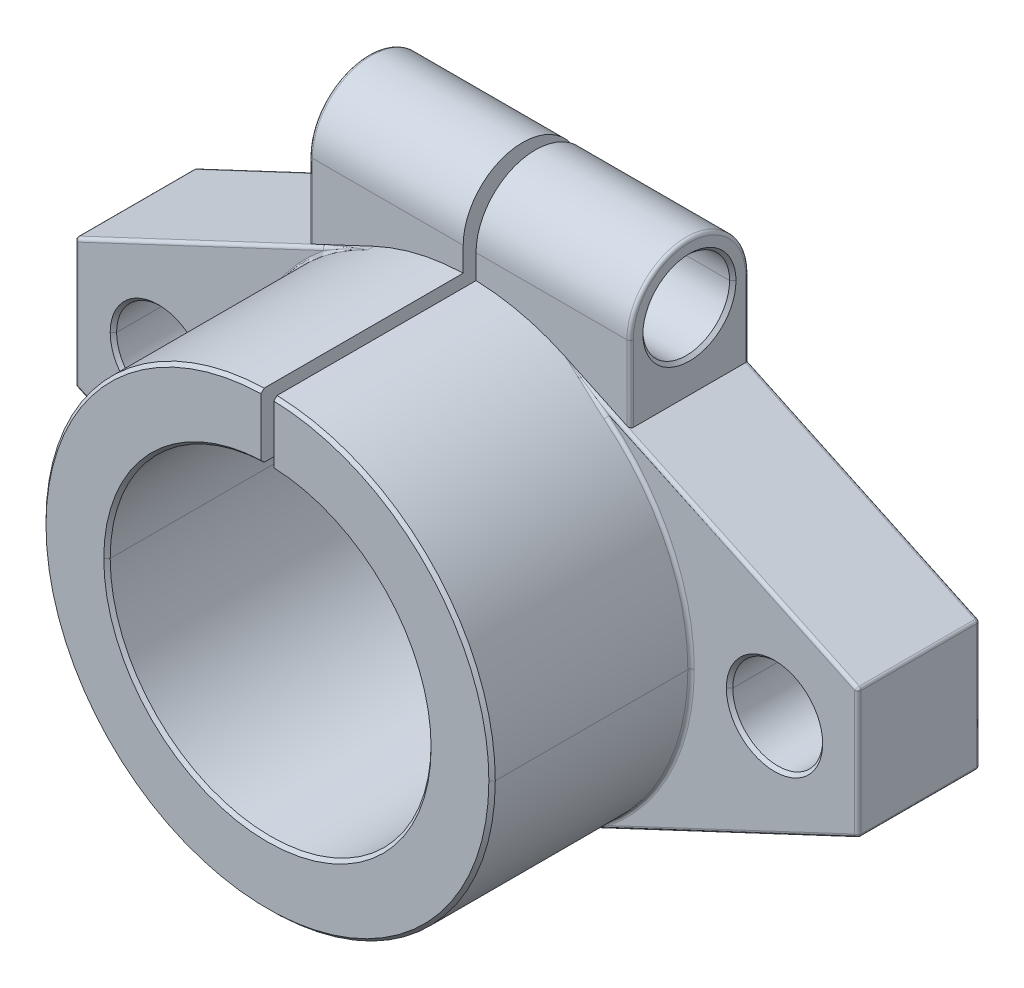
ISO-10303-21;
HEADER;
FILE_DESCRIPTION(('STEP AP214'),'2;1');
FILE_NAME('part.step','',(''),(''),'','','');
FILE_SCHEMA(('AUTOMOTIVE_DESIGN { 1 0 10303 214 1 1 1 1 }'));
ENDSEC;
DATA;
#1=APPLICATION_CONTEXT('core data for automotive mechanical design processes');
#2=APPLICATION_PROTOCOL_DEFINITION('international standard','automotive_design',2000,#1);
#3=PRODUCT_CONTEXT('',#1,'mechanical');
#4=PRODUCT('Part','Part','',(#3));
#5=PRODUCT_RELATED_PRODUCT_CATEGORY('part','',(#4));
#6=PRODUCT_DEFINITION_FORMATION('','',#4);
#7=PRODUCT_DEFINITION_CONTEXT('part definition',#1,'design');
#8=PRODUCT_DEFINITION('design','',#6,#7);
#9=PRODUCT_DEFINITION_SHAPE('','',#8);
#10=(LENGTH_UNIT() NAMED_UNIT(*) SI_UNIT(.MILLI.,.METRE.));
#11=(NAMED_UNIT(*) PLANE_ANGLE_UNIT() SI_UNIT($,.RADIAN.));
#12=(NAMED_UNIT(*) SI_UNIT($,.STERADIAN.) SOLID_ANGLE_UNIT());
#13=UNCERTAINTY_MEASURE_WITH_UNIT(LENGTH_MEASURE(1.E-05),#10,'distance_accuracy_value','');
#14=(GEOMETRIC_REPRESENTATION_CONTEXT(3) GLOBAL_UNCERTAINTY_ASSIGNED_CONTEXT((#13)) GLOBAL_UNIT_ASSIGNED_CONTEXT((#10,
#11,#12)) REPRESENTATION_CONTEXT('',''));
#15=CARTESIAN_POINT('',(0.,0.,0.));
#16=DIRECTION('',(0.,0.,1.));
#17=DIRECTION('',(1.,0.,0.));
#18=AXIS2_PLACEMENT_3D('',#15,#16,#17);
#19=CARTESIAN_POINT('',(0.,0.,50.));
#20=DIRECTION('',(0.,0.,-1.));
#21=DIRECTION('',(-1.,0.,0.));
#22=AXIS2_PLACEMENT_3D('',#19,#20,#21);
#23=CONICAL_SURFACE('',#22,34.5,0.785398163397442);
#24=CARTESIAN_POINT('',(0.,0.,50.));
#25=DIRECTION('',(0.,0.,1.));
#26=DIRECTION('',(1.,0.,0.));
#27=AXIS2_PLACEMENT_3D('',#24,#25,#26);
#28=CIRCLE('',#27,34.5);
#29=CARTESIAN_POINT('',(34.5,0.,50.));
#30=VERTEX_POINT('',#29);
#31=CARTESIAN_POINT('',(1.,34.4855042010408,50.));
#32=VERTEX_POINT('',#31);
#33=EDGE_CURVE('E307',#30,#32,#28,.T.);
#34=ORIENTED_EDGE('',*,*,#33,.F.);
#35=DIRECTION('',(0.707106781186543,0.,-0.707106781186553));
#36=VECTOR('',#35,1.);
#37=CARTESIAN_POINT('',(34.5,0.,50.));
#38=LINE('',#37,#36);
#39=CARTESIAN_POINT('',(35.,0.,49.5));
#40=VERTEX_POINT('',#39);
#41=EDGE_CURVE('E10',#30,#40,#38,.T.);
#42=ORIENTED_EDGE('',*,*,#41,.T.);
#43=CARTESIAN_POINT('',(0.,0.,49.5));
#44=DIRECTION('',(0.,0.,-1.));
#45=DIRECTION('',(1.,0.,0.));
#46=AXIS2_PLACEMENT_3D('',#43,#44,#45);
#47=CIRCLE('',#46,35.);
#48=CARTESIAN_POINT('',(1.,34.9857113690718,49.5));
#49=VERTEX_POINT('',#48);
#50=EDGE_CURVE('E332',#49,#40,#47,.T.);
#51=ORIENTED_EDGE('',*,*,#50,.F.);
#52=CARTESIAN_POINT('',(1.,34.4855042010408,50.));
#53=CARTESIAN_POINT('',(1.,34.652240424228,49.8333338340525));
#54=CARTESIAN_POINT('',(1.,34.8189761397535,49.6666671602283));
#55=CARTESIAN_POINT('',(1.,34.9857113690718,49.5));
#56=(BOUNDED_CURVE() B_SPLINE_CURVE(3,(#52,#53,#54,#55),.UNSPECIFIED.,.F.,
.F.) B_SPLINE_CURVE_WITH_KNOTS((4,4),(0.,0.000707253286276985),
.UNSPECIFIED.) CURVE() GEOMETRIC_REPRESENTATION_ITEM() RATIONAL_B_SPLINE_CURVE((1.,1.,1.,1.)) REPRESENTATION_ITEM(''));
#57=EDGE_CURVE('E1381',#32,#49,#56,.T.);
#58=ORIENTED_EDGE('',*,*,#57,.F.);
#59=EDGE_LOOP('',(#34,#42,#51,#58));
#60=FACE_BOUND('',#59,.T.);
#61=ADVANCED_FACE('F16',(#60),#23,.T.);
#62=CARTESIAN_POINT('',(0.,0.,50.));
#63=DIRECTION('',(0.,0.,-1.));
#64=DIRECTION('',(-1.,0.,0.));
#65=AXIS2_PLACEMENT_3D('',#62,#63,#64);
#66=CONICAL_SURFACE('',#65,34.5,0.785398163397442);
#67=ORIENTED_EDGE('',*,*,#41,.F.);
#68=CARTESIAN_POINT('',(0.,0.,50.));
#69=DIRECTION('',(0.,0.,1.));
#70=DIRECTION('',(1.,0.,0.));
#71=AXIS2_PLACEMENT_3D('',#68,#69,#70);
#72=CIRCLE('',#71,34.5);
#73=CARTESIAN_POINT('',(-34.5,0.,50.));
#74=VERTEX_POINT('',#73);
#75=EDGE_CURVE('E313',#74,#30,#72,.T.);
#76=ORIENTED_EDGE('',*,*,#75,.F.);
#77=DIRECTION('',(-0.707106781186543,0.,-0.707106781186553));
#78=VECTOR('',#77,1.);
#79=CARTESIAN_POINT('',(-34.5,0.,50.));
#80=LINE('',#79,#78);
#81=CARTESIAN_POINT('',(-35.,0.,49.5));
#82=VERTEX_POINT('',#81);
#83=EDGE_CURVE('E1411',#74,#82,#80,.T.);
#84=ORIENTED_EDGE('',*,*,#83,.T.);
#85=CARTESIAN_POINT('',(0.,0.,49.5));
#86=DIRECTION('',(0.,0.,-1.));
#87=DIRECTION('',(1.,0.,0.));
#88=AXIS2_PLACEMENT_3D('',#85,#86,#87);
#89=CIRCLE('',#88,35.);
#90=EDGE_CURVE('E331',#40,#82,#89,.T.);
#91=ORIENTED_EDGE('',*,*,#90,.F.);
#92=EDGE_LOOP('',(#67,#76,#84,#91));
#93=FACE_BOUND('',#92,.T.);
#94=ADVANCED_FACE('F491',(#93),#66,.T.);
#95=CARTESIAN_POINT('',(0.,0.,49.5));
#96=DIRECTION('',(0.,0.,1.));
#97=DIRECTION('',(1.,0.,0.));
#98=AXIS2_PLACEMENT_3D('',#95,#96,#97);
#99=CONICAL_SURFACE('',#98,25.,0.785398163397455);
#100=CARTESIAN_POINT('',(0.,0.,49.5));
#101=DIRECTION('',(0.,0.,1.));
#102=DIRECTION('',(1.,0.,0.));
#103=AXIS2_PLACEMENT_3D('',#100,#101,#102);
#104=CIRCLE('',#103,25.);
#105=CARTESIAN_POINT('',(-25.,0.,49.5));
#106=VERTEX_POINT('',#105);
#107=CARTESIAN_POINT('',(25.,0.,49.5));
#108=VERTEX_POINT('',#107);
#109=EDGE_CURVE('E267',#106,#108,#104,.T.);
#110=ORIENTED_EDGE('',*,*,#109,.F.);
#111=DIRECTION('',(-0.707106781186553,0.,0.707106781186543));
#112=VECTOR('',#111,1.);
#113=CARTESIAN_POINT('',(-25.,0.,49.5));
#114=LINE('',#113,#112);
#115=CARTESIAN_POINT('',(-25.5,0.,50.));
#116=VERTEX_POINT('',#115);
#117=EDGE_CURVE('E1436',#106,#116,#114,.T.);
#118=ORIENTED_EDGE('',*,*,#117,.T.);
#119=CARTESIAN_POINT('',(0.,0.,50.));
#120=DIRECTION('',(0.,0.,-1.));
#121=DIRECTION('',(1.,0.,0.));
#122=AXIS2_PLACEMENT_3D('',#119,#120,#121);
#123=CIRCLE('',#122,25.5);
#124=CARTESIAN_POINT('',(25.5,0.,50.));
#125=VERTEX_POINT('',#124);
#126=EDGE_CURVE('E270',#125,#116,#123,.T.);
#127=ORIENTED_EDGE('',*,*,#126,.F.);
#128=DIRECTION('',(0.707106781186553,0.,0.707106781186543));
#129=VECTOR('',#128,1.);
#130=CARTESIAN_POINT('',(25.,0.,49.5));
#131=LINE('',#130,#129);
#132=EDGE_CURVE('E27',#108,#125,#131,.T.);
#133=ORIENTED_EDGE('',*,*,#132,.F.);
#134=EDGE_LOOP('',(#110,#118,#127,#133));
#135=FACE_BOUND('',#134,.T.);
#136=ADVANCED_FACE('F18',(#135),#99,.F.);
#137=CARTESIAN_POINT('',(0.,0.,49.5));
#138=DIRECTION('',(0.,0.,1.));
#139=DIRECTION('',(1.,0.,0.));
#140=AXIS2_PLACEMENT_3D('',#137,#138,#139);
#141=CONICAL_SURFACE('',#140,25.,0.785398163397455);
#142=CARTESIAN_POINT('',(0.,0.,49.5));
#143=DIRECTION('',(0.,0.,1.));
#144=DIRECTION('',(1.,0.,0.));
#145=AXIS2_PLACEMENT_3D('',#142,#143,#144);
#146=CIRCLE('',#145,25.);
#147=CARTESIAN_POINT('',(1.,24.9799919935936,49.5));
#148=VERTEX_POINT('',#147);
#149=EDGE_CURVE('E292',#108,#148,#146,.T.);
#150=ORIENTED_EDGE('',*,*,#149,.F.);
#151=ORIENTED_EDGE('',*,*,#132,.T.);
#152=CARTESIAN_POINT('',(0.,0.,50.));
#153=DIRECTION('',(0.,0.,-1.));
#154=DIRECTION('',(1.,0.,0.));
#155=AXIS2_PLACEMENT_3D('',#152,#153,#154);
#156=CIRCLE('',#155,25.5);
#157=CARTESIAN_POINT('',(1.,25.4803846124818,50.));
#158=VERTEX_POINT('',#157);
#159=EDGE_CURVE('E1856',#158,#125,#156,.T.);
#160=ORIENTED_EDGE('',*,*,#159,.F.);
#161=CARTESIAN_POINT('',(1.,24.9799919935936,49.5));
#162=CARTESIAN_POINT('',(1.,25.1467908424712,49.6666653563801));
#163=CARTESIAN_POINT('',(1.,25.3135883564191,49.8333320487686));
#164=CARTESIAN_POINT('',(1.,25.4803846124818,50.));
#165=(BOUNDED_CURVE() B_SPLINE_CURVE(3,(#161,#162,#163,#164),.UNSPECIFIED.,.F.,
.F.) B_SPLINE_CURVE_WITH_KNOTS((4,4),(0.,0.000707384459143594),
.UNSPECIFIED.) CURVE() GEOMETRIC_REPRESENTATION_ITEM() RATIONAL_B_SPLINE_CURVE((1.,1.,1.,1.)) REPRESENTATION_ITEM(''));
#166=EDGE_CURVE('E295',#148,#158,#165,.T.);
#167=ORIENTED_EDGE('',*,*,#166,.F.);
#168=EDGE_LOOP('',(#150,#151,#160,#167));
#169=FACE_BOUND('',#168,.T.);
#170=ADVANCED_FACE('F293',(#169),#141,.F.);
#171=CARTESIAN_POINT('',(0.,0.,0.));
#172=DIRECTION('',(0.,0.,-1.));
#173=DIRECTION('',(-1.,0.,0.));
#174=AXIS2_PLACEMENT_3D('',#171,#172,#173);
#175=CONICAL_SURFACE('',#174,25.5,0.785398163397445);
#176=CARTESIAN_POINT('',(0.,0.,0.500000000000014));
#177=DIRECTION('',(0.,0.,-1.));
#178=DIRECTION('',(1.,0.,0.));
#179=AXIS2_PLACEMENT_3D('',#176,#177,#178);
#180=CIRCLE('',#179,25.);
#181=CARTESIAN_POINT('',(25.,0.,0.500000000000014));
#182=VERTEX_POINT('',#181);
#183=CARTESIAN_POINT('',(-25.,0.,0.500000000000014));
#184=VERTEX_POINT('',#183);
#185=EDGE_CURVE('E288',#182,#184,#180,.T.);
#186=ORIENTED_EDGE('',*,*,#185,.F.);
#187=DIRECTION('',(0.707106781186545,0.,-0.70710678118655));
#188=VECTOR('',#187,1.);
#189=CARTESIAN_POINT('',(25.5,0.,0.));
#190=LINE('',#189,#188);
#191=CARTESIAN_POINT('',(25.5,0.,0.));
#192=VERTEX_POINT('',#191);
#193=EDGE_CURVE('E1463',#182,#192,#190,.T.);
#194=ORIENTED_EDGE('',*,*,#193,.T.);
#195=CARTESIAN_POINT('',(0.,0.,0.));
#196=DIRECTION('',(0.,0.,1.));
#197=DIRECTION('',(1.,0.,0.));
#198=AXIS2_PLACEMENT_3D('',#195,#196,#197);
#199=CIRCLE('',#198,25.5);
#200=CARTESIAN_POINT('',(-25.5,0.,0.));
#201=VERTEX_POINT('',#200);
#202=EDGE_CURVE('E1847',#201,#192,#199,.T.);
#203=ORIENTED_EDGE('',*,*,#202,.F.);
#204=DIRECTION('',(-0.707106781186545,0.,-0.70710678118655));
#205=VECTOR('',#204,1.);
#206=CARTESIAN_POINT('',(-25.5,0.,0.));
#207=LINE('',#206,#205);
#208=EDGE_CURVE('E41',#184,#201,#207,.T.);
#209=ORIENTED_EDGE('',*,*,#208,.F.);
#210=EDGE_LOOP('',(#186,#194,#203,#209));
#211=FACE_BOUND('',#210,.T.);
#212=ADVANCED_FACE('F527',(#211),#175,.F.);
#213=CARTESIAN_POINT('',(0.,0.,0.));
#214=DIRECTION('',(0.,0.,-1.));
#215=DIRECTION('',(-1.,0.,0.));
#216=AXIS2_PLACEMENT_3D('',#213,#214,#215);
#217=CONICAL_SURFACE('',#216,25.5,0.785398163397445);
#218=CARTESIAN_POINT('',(0.,0.,0.500000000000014));
#219=DIRECTION('',(0.,0.,-1.));
#220=DIRECTION('',(1.,0.,0.));
#221=AXIS2_PLACEMENT_3D('',#218,#219,#220);
#222=CIRCLE('',#221,25.);
#223=CARTESIAN_POINT('',(-1.,24.9799919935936,0.500000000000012));
#224=VERTEX_POINT('',#223);
#225=EDGE_CURVE('E289',#184,#224,#222,.T.);
#226=ORIENTED_EDGE('',*,*,#225,.F.);
#227=ORIENTED_EDGE('',*,*,#208,.T.);
#228=CARTESIAN_POINT('',(0.,0.,0.));
#229=DIRECTION('',(0.,0.,1.));
#230=DIRECTION('',(1.,0.,0.));
#231=AXIS2_PLACEMENT_3D('',#228,#229,#230);
#232=CIRCLE('',#231,25.5);
#233=CARTESIAN_POINT('',(-1.,25.4803846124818,0.));
#234=VERTEX_POINT('',#233);
#235=EDGE_CURVE('E1843',#234,#201,#232,.T.);
#236=ORIENTED_EDGE('',*,*,#235,.F.);
#237=CARTESIAN_POINT('',(-1.,24.9799919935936,0.500000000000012));
#238=CARTESIAN_POINT('',(-1.,25.1467908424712,0.333334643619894));
#239=CARTESIAN_POINT('',(-1.,25.3135883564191,0.166667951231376));
#240=CARTESIAN_POINT('',(-1.,25.4803846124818,0.));
#241=(BOUNDED_CURVE() B_SPLINE_CURVE(3,(#237,#238,#239,#240),.UNSPECIFIED.,.F.,
.F.) B_SPLINE_CURVE_WITH_KNOTS((4,4),(0.,0.000707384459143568),
.UNSPECIFIED.) CURVE() GEOMETRIC_REPRESENTATION_ITEM() RATIONAL_B_SPLINE_CURVE((1.,1.,1.,1.)) REPRESENTATION_ITEM(''));
#242=EDGE_CURVE('E1709',#224,#234,#241,.T.);
#243=ORIENTED_EDGE('',*,*,#242,.F.);
#244=EDGE_LOOP('',(#226,#227,#236,#243));
#245=FACE_BOUND('',#244,.T.);
#246=ADVANCED_FACE('F524',(#245),#217,.F.);
#247=CARTESIAN_POINT('',(24.5,38.75,9.25));
#248=DIRECTION('',(1.,0.,0.));
#249=DIRECTION('',(0.,0.,-1.));
#250=AXIS2_PLACEMENT_3D('',#247,#248,#249);
#251=CONICAL_SURFACE('',#250,6.75,0.78539816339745);
#252=CARTESIAN_POINT('',(24.5,38.75,9.25));
#253=DIRECTION('',(1.,0.,0.));
#254=DIRECTION('',(0.,0.,-1.));
#255=AXIS2_PLACEMENT_3D('',#252,#253,#254);
#256=CIRCLE('',#255,6.75);
#257=CARTESIAN_POINT('',(24.5,38.75,16.));
#258=VERTEX_POINT('',#257);
#259=CARTESIAN_POINT('',(24.5,38.75,2.5));
#260=VERTEX_POINT('',#259);
#261=EDGE_CURVE('E348',#258,#260,#256,.T.);
#262=ORIENTED_EDGE('',*,*,#261,.F.);
#263=DIRECTION('',(0.707106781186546,0.,0.707106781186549));
#264=VECTOR('',#263,1.);
#265=CARTESIAN_POINT('',(24.5,38.75,16.));
#266=LINE('',#265,#264);
#267=CARTESIAN_POINT('',(25.,38.75,16.5));
#268=VERTEX_POINT('',#267);
#269=EDGE_CURVE('E1386',#258,#268,#266,.T.);
#270=ORIENTED_EDGE('',*,*,#269,.T.);
#271=CARTESIAN_POINT('',(25.,38.75,9.25));
#272=DIRECTION('',(-1.,0.,0.));
#273=DIRECTION('',(0.,0.,-1.));
#274=AXIS2_PLACEMENT_3D('',#271,#272,#273);
#275=CIRCLE('',#274,7.25);
#276=CARTESIAN_POINT('',(25.,38.75,1.99999999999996));
#277=VERTEX_POINT('',#276);
#278=EDGE_CURVE('E1807',#277,#268,#275,.T.);
#279=ORIENTED_EDGE('',*,*,#278,.F.);
#280=DIRECTION('',(0.707106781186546,0.,-0.707106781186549));
#281=VECTOR('',#280,1.);
#282=CARTESIAN_POINT('',(24.5,38.75,2.5));
#283=LINE('',#282,#281);
#284=EDGE_CURVE('E1476',#260,#277,#283,.T.);
#285=ORIENTED_EDGE('',*,*,#284,.F.);
#286=EDGE_LOOP('',(#262,#270,#279,#285));
#287=FACE_BOUND('',#286,.T.);
#288=ADVANCED_FACE('F522',(#287),#251,.F.);
#289=CARTESIAN_POINT('',(-48.,0.,18.5));
#290=DIRECTION('',(0.,0.,1.));
#291=DIRECTION('',(1.,0.,0.));
#292=AXIS2_PLACEMENT_3D('',#289,#290,#291);
#293=CONICAL_SURFACE('',#292,7.,0.785398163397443);
#294=CARTESIAN_POINT('',(-48.,0.,18.5));
#295=DIRECTION('',(0.,0.,1.));
#296=DIRECTION('',(1.,0.,0.));
#297=AXIS2_PLACEMENT_3D('',#294,#295,#296);
#298=CIRCLE('',#297,7.);
#299=CARTESIAN_POINT('',(-55.,0.,18.5));
#300=VERTEX_POINT('',#299);
#301=CARTESIAN_POINT('',(-41.,0.,18.5));
#302=VERTEX_POINT('',#301);
#303=EDGE_CURVE('E339',#300,#302,#298,.T.);
#304=ORIENTED_EDGE('',*,*,#303,.F.);
#305=DIRECTION('',(-0.707106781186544,0.,0.707106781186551));
#306=VECTOR('',#305,1.);
#307=CARTESIAN_POINT('',(-55.,0.,18.5));
#308=LINE('',#307,#306);
#309=CARTESIAN_POINT('',(-55.5,0.,19.));
#310=VERTEX_POINT('',#309);
#311=EDGE_CURVE('E1492',#300,#310,#308,.T.);
#312=ORIENTED_EDGE('',*,*,#311,.T.);
#313=CARTESIAN_POINT('',(-48.,0.,19.));
#314=DIRECTION('',(0.,0.,-1.));
#315=DIRECTION('',(1.,0.,0.));
#316=AXIS2_PLACEMENT_3D('',#313,#314,#315);
#317=CIRCLE('',#316,7.5);
#318=CARTESIAN_POINT('',(-40.5,0.,19.));
#319=VERTEX_POINT('',#318);
#320=EDGE_CURVE('E418',#319,#310,#317,.T.);
#321=ORIENTED_EDGE('',*,*,#320,.F.);
#322=DIRECTION('',(0.707106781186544,0.,0.707106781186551));
#323=VECTOR('',#322,1.);
#324=CARTESIAN_POINT('',(-41.,0.,18.5));
#325=LINE('',#324,#323);
#326=EDGE_CURVE('E1506',#302,#319,#325,.T.);
#327=ORIENTED_EDGE('',*,*,#326,.F.);
#328=EDGE_LOOP('',(#304,#312,#321,#327));
#329=FACE_BOUND('',#328,.T.);
#330=ADVANCED_FACE('F520',(#329),#293,.F.);
#331=CARTESIAN_POINT('',(-48.,0.,0.));
#332=DIRECTION('',(0.,0.,-1.));
#333=DIRECTION('',(-1.,0.,0.));
#334=AXIS2_PLACEMENT_3D('',#331,#332,#333);
#335=CONICAL_SURFACE('',#334,7.5,0.78539816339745);
#336=CARTESIAN_POINT('',(-48.,0.,0.49999999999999));
#337=DIRECTION('',(0.,0.,-1.));
#338=DIRECTION('',(1.,0.,0.));
#339=AXIS2_PLACEMENT_3D('',#336,#337,#338);
#340=CIRCLE('',#339,7.);
#341=CARTESIAN_POINT('',(-41.,0.,0.49999999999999));
#342=VERTEX_POINT('',#341);
#343=CARTESIAN_POINT('',(-55.,0.,0.49999999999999));
#344=VERTEX_POINT('',#343);
#345=EDGE_CURVE('E343',#342,#344,#340,.T.);
#346=ORIENTED_EDGE('',*,*,#345,.F.);
#347=DIRECTION('',(0.707106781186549,0.,-0.707106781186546));
#348=VECTOR('',#347,1.);
#349=CARTESIAN_POINT('',(-40.5,0.,0.));
#350=LINE('',#349,#348);
#351=CARTESIAN_POINT('',(-40.5,0.,0.));
#352=VERTEX_POINT('',#351);
#353=EDGE_CURVE('E1526',#342,#352,#350,.T.);
#354=ORIENTED_EDGE('',*,*,#353,.T.);
#355=CARTESIAN_POINT('',(-48.,0.,0.));
#356=DIRECTION('',(0.,0.,1.));
#357=DIRECTION('',(1.,0.,0.));
#358=AXIS2_PLACEMENT_3D('',#355,#356,#357);
#359=CIRCLE('',#358,7.5);
#360=CARTESIAN_POINT('',(-55.5,0.,0.));
#361=VERTEX_POINT('',#360);
#362=EDGE_CURVE('E1850',#361,#352,#359,.T.);
#363=ORIENTED_EDGE('',*,*,#362,.F.);
#364=DIRECTION('',(-0.707106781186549,0.,-0.707106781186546));
#365=VECTOR('',#364,1.);
#366=CARTESIAN_POINT('',(-55.5,0.,0.));
#367=LINE('',#366,#365);
#368=EDGE_CURVE('E1289',#344,#361,#367,.T.);
#369=ORIENTED_EDGE('',*,*,#368,.F.);
#370=EDGE_LOOP('',(#346,#354,#363,#369));
#371=FACE_BOUND('',#370,.T.);
#372=ADVANCED_FACE('F516',(#371),#335,.F.);
#373=CARTESIAN_POINT('',(48.,0.,19.));
#374=DIRECTION('',(0.,0.,1.));
#375=DIRECTION('',(1.,0.,0.));
#376=AXIS2_PLACEMENT_3D('',#373,#374,#375);
#377=CONICAL_SURFACE('',#376,7.5,0.78539816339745);
#378=CARTESIAN_POINT('',(48.,0.,18.5));
#379=DIRECTION('',(0.,0.,1.));
#380=DIRECTION('',(1.,0.,0.));
#381=AXIS2_PLACEMENT_3D('',#378,#379,#380);
#382=CIRCLE('',#381,7.);
#383=CARTESIAN_POINT('',(41.,0.,18.5));
#384=VERTEX_POINT('',#383);
#385=CARTESIAN_POINT('',(55.,0.,18.5));
#386=VERTEX_POINT('',#385);
#387=EDGE_CURVE('E349',#384,#386,#382,.T.);
#388=ORIENTED_EDGE('',*,*,#387,.F.);
#389=DIRECTION('',(-0.707106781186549,0.,0.707106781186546));
#390=VECTOR('',#389,1.);
#391=CARTESIAN_POINT('',(40.5,0.,19.));
#392=LINE('',#391,#390);
#393=CARTESIAN_POINT('',(40.5,0.,19.));
#394=VERTEX_POINT('',#393);
#395=EDGE_CURVE('E1272',#384,#394,#392,.T.);
#396=ORIENTED_EDGE('',*,*,#395,.T.);
#397=CARTESIAN_POINT('',(48.,0.,19.));
#398=DIRECTION('',(0.,0.,-1.));
#399=DIRECTION('',(1.,0.,0.));
#400=AXIS2_PLACEMENT_3D('',#397,#398,#399);
#401=CIRCLE('',#400,7.5);
#402=CARTESIAN_POINT('',(55.5,0.,19.));
#403=VERTEX_POINT('',#402);
#404=EDGE_CURVE('E1256',#403,#394,#401,.T.);
#405=ORIENTED_EDGE('',*,*,#404,.F.);
#406=DIRECTION('',(0.707106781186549,0.,0.707106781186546));
#407=VECTOR('',#406,1.);
#408=CARTESIAN_POINT('',(55.5,0.,19.));
#409=LINE('',#408,#407);
#410=EDGE_CURVE('E1273',#386,#403,#409,.T.);
#411=ORIENTED_EDGE('',*,*,#410,.F.);
#412=EDGE_LOOP('',(#388,#396,#405,#411));
#413=FACE_BOUND('',#412,.T.);
#414=ADVANCED_FACE('F512',(#413),#377,.F.);
#415=CARTESIAN_POINT('',(48.,0.,0.500000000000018));
#416=DIRECTION('',(0.,0.,-1.));
#417=DIRECTION('',(-1.,0.,0.));
#418=AXIS2_PLACEMENT_3D('',#415,#416,#417);
#419=CONICAL_SURFACE('',#418,7.,0.785398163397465);
#420=CARTESIAN_POINT('',(48.,0.,0.500000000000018));
#421=DIRECTION('',(0.,0.,-1.));
#422=DIRECTION('',(1.,0.,0.));
#423=AXIS2_PLACEMENT_3D('',#420,#421,#422);
#424=CIRCLE('',#423,7.);
#425=CARTESIAN_POINT('',(55.,0.,0.500000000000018));
#426=VERTEX_POINT('',#425);
#427=CARTESIAN_POINT('',(41.,0.,0.500000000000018));
#428=VERTEX_POINT('',#427);
#429=EDGE_CURVE('E344',#426,#428,#424,.T.);
#430=ORIENTED_EDGE('',*,*,#429,.F.);
#431=DIRECTION('',(0.707106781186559,0.,-0.707106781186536));
#432=VECTOR('',#431,1.);
#433=CARTESIAN_POINT('',(55.,0.,0.500000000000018));
#434=LINE('',#433,#432);
#435=CARTESIAN_POINT('',(55.5,0.,0.));
#436=VERTEX_POINT('',#435);
#437=EDGE_CURVE('E1275',#426,#436,#434,.T.);
#438=ORIENTED_EDGE('',*,*,#437,.T.);
#439=CARTESIAN_POINT('',(48.,0.,0.));
#440=DIRECTION('',(0.,0.,1.));
#441=DIRECTION('',(1.,0.,0.));
#442=AXIS2_PLACEMENT_3D('',#439,#440,#441);
#443=CIRCLE('',#442,7.5);
#444=CARTESIAN_POINT('',(40.5,0.,0.));
#445=VERTEX_POINT('',#444);
#446=EDGE_CURVE('E1853',#445,#436,#443,.T.);
#447=ORIENTED_EDGE('',*,*,#446,.F.);
#448=DIRECTION('',(-0.707106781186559,0.,-0.707106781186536));
#449=VECTOR('',#448,1.);
#450=CARTESIAN_POINT('',(41.,0.,0.500000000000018));
#451=LINE('',#450,#449);
#452=EDGE_CURVE('E1563',#428,#445,#451,.T.);
#453=ORIENTED_EDGE('',*,*,#452,.F.);
#454=EDGE_LOOP('',(#430,#438,#447,#453));
#455=FACE_BOUND('',#454,.T.);
#456=ADVANCED_FACE('F509',(#455),#419,.F.);
#457=CARTESIAN_POINT('',(0.,0.,19.5));
#458=DIRECTION('',(0.,0.,1.));
#459=DIRECTION('',(1.,0.,0.));
#460=AXIS2_PLACEMENT_3D('',#457,#458,#459);
#461=TOROIDAL_SURFACE('',#460,35.5,0.5);
#462=CARTESIAN_POINT('',(0.,0.,19.5));
#463=DIRECTION('',(0.,0.,1.));
#464=DIRECTION('',(1.,0.,0.));
#465=AXIS2_PLACEMENT_3D('',#462,#463,#464);
#466=CIRCLE('',#465,35.);
#467=CARTESIAN_POINT('',(35.,0.,19.5));
#468=VERTEX_POINT('',#467);
#469=CARTESIAN_POINT('',(21.9350570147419,27.2736736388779,19.5));
#470=VERTEX_POINT('',#469);
#471=EDGE_CURVE('E336',#468,#470,#466,.T.);
#472=ORIENTED_EDGE('',*,*,#471,.F.);
#473=CARTESIAN_POINT('',(35.5,0.,19.5));
#474=DIRECTION('',(0.,-1.,0.));
#475=DIRECTION('',(0.,0.,-1.));
#476=AXIS2_PLACEMENT_3D('',#473,#474,#475);
#477=CIRCLE('',#476,0.5);
#478=CARTESIAN_POINT('',(35.5,0.,19.));
#479=VERTEX_POINT('',#478);
#480=EDGE_CURVE('E434',#468,#479,#477,.T.);
#481=ORIENTED_EDGE('',*,*,#480,.T.);
#482=CARTESIAN_POINT('',(0.,0.,19.));
#483=DIRECTION('',(0.,0.,-1.));
#484=DIRECTION('',(1.,0.,0.));
#485=AXIS2_PLACEMENT_3D('',#482,#483,#484);
#486=CIRCLE('',#485,35.5);
#487=CARTESIAN_POINT('',(22.2484149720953,27.6632975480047,19.));
#488=VERTEX_POINT('',#487);
#489=EDGE_CURVE('E1266',#488,#479,#486,.T.);
#490=ORIENTED_EDGE('',*,*,#489,.F.);
#491=CARTESIAN_POINT('',(22.2484149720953,27.6632975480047,19.5));
#492=DIRECTION('',(-0.779247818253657,0.626715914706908,0.));
#493=DIRECTION('',(-0.626715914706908,-0.779247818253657,0.));
#494=AXIS2_PLACEMENT_3D('',#491,#492,#493);
#495=CIRCLE('',#494,0.5);
#496=EDGE_CURVE('E3782',#488,#470,#495,.T.);
#497=ORIENTED_EDGE('',*,*,#496,.T.);
#498=EDGE_LOOP('',(#472,#481,#490,#497));
#499=FACE_BOUND('',#498,.T.);
#500=ADVANCED_FACE('F507',(#499),#461,.F.);
#501=CARTESIAN_POINT('',(-1.,38.75,9.25));
#502=DIRECTION('',(1.,0.,0.));
#503=DIRECTION('',(0.,0.,-1.));
#504=AXIS2_PLACEMENT_3D('',#501,#502,#503);
#505=CYLINDRICAL_SURFACE('',#504,5.1);
#506=CARTESIAN_POINT('',(-25.,38.75,9.25));
#507=DIRECTION('',(1.,0.,0.));
#508=DIRECTION('',(0.,0.,-1.));
#509=AXIS2_PLACEMENT_3D('',#506,#507,#508);
#510=CIRCLE('',#509,5.1);
#511=CARTESIAN_POINT('',(-25.,38.75,14.35));
#512=VERTEX_POINT('',#511);
#513=CARTESIAN_POINT('',(-25.,38.75,4.15));
#514=VERTEX_POINT('',#513);
#515=EDGE_CURVE('E1440',#512,#514,#510,.T.);
#516=ORIENTED_EDGE('',*,*,#515,.F.);
#517=DIRECTION('',(1.,0.,0.));
#518=VECTOR('',#517,1.);
#519=CARTESIAN_POINT('',(-1.,38.75,14.35));
#520=LINE('',#519,#518);
#521=CARTESIAN_POINT('',(-1.,38.75,14.35));
#522=VERTEX_POINT('',#521);
#523=EDGE_CURVE('E1718',#512,#522,#520,.T.);
#524=ORIENTED_EDGE('',*,*,#523,.T.);
#525=CARTESIAN_POINT('',(-1.,38.75,9.25));
#526=DIRECTION('',(1.,0.,0.));
#527=DIRECTION('',(0.,0.,-1.));
#528=AXIS2_PLACEMENT_3D('',#525,#526,#527);
#529=CIRCLE('',#528,5.1);
#530=CARTESIAN_POINT('',(-1.,38.75,4.15));
#531=VERTEX_POINT('',#530);
#532=EDGE_CURVE('E1800',#522,#531,#529,.T.);
#533=ORIENTED_EDGE('',*,*,#532,.T.);
#534=DIRECTION('',(1.,0.,0.));
#535=VECTOR('',#534,1.);
#536=CARTESIAN_POINT('',(-1.,38.75,4.15));
#537=LINE('',#536,#535);
#538=EDGE_CURVE('E1727',#514,#531,#537,.T.);
#539=ORIENTED_EDGE('',*,*,#538,.F.);
#540=EDGE_LOOP('',(#516,#524,#533,#539));
#541=FACE_BOUND('',#540,.T.);
#542=ADVANCED_FACE('F504',(#541),#505,.F.);
#543=CARTESIAN_POINT('',(1.,38.75,9.25));
#544=DIRECTION('',(-1.,0.,0.));
#545=DIRECTION('',(0.,0.,1.));
#546=AXIS2_PLACEMENT_3D('',#543,#544,#545);
#547=CYLINDRICAL_SURFACE('',#546,6.75);
#548=ORIENTED_EDGE('',*,*,#261,.T.);
#549=DIRECTION('',(-1.,0.,0.));
#550=VECTOR('',#549,1.);
#551=CARTESIAN_POINT('',(1.,38.75,2.5));
#552=LINE('',#551,#550);
#553=CARTESIAN_POINT('',(1.,38.75,2.5));
#554=VERTEX_POINT('',#553);
#555=EDGE_CURVE('E1737',#260,#554,#552,.T.);
#556=ORIENTED_EDGE('',*,*,#555,.T.);
#557=CARTESIAN_POINT('',(1.,38.75,9.25));
#558=DIRECTION('',(-1.,0.,0.));
#559=DIRECTION('',(0.,0.,1.));
#560=AXIS2_PLACEMENT_3D('',#557,#558,#559);
#561=CIRCLE('',#560,6.75);
#562=CARTESIAN_POINT('',(1.,38.75,16.));
#563=VERTEX_POINT('',#562);
#564=EDGE_CURVE('E1778',#554,#563,#561,.T.);
#565=ORIENTED_EDGE('',*,*,#564,.T.);
#566=DIRECTION('',(-1.,0.,0.));
#567=VECTOR('',#566,1.);
#568=CARTESIAN_POINT('',(1.,38.75,16.));
#569=LINE('',#568,#567);
#570=EDGE_CURVE('E1522',#258,#563,#569,.T.);
#571=ORIENTED_EDGE('',*,*,#570,.F.);
#572=EDGE_LOOP('',(#548,#556,#565,#571));
#573=FACE_BOUND('',#572,.T.);
#574=ADVANCED_FACE('F502',(#573),#547,.F.);
#575=CARTESIAN_POINT('',(48.,0.,19.));
#576=DIRECTION('',(0.,0.,-1.));
#577=DIRECTION('',(-1.,0.,0.));
#578=AXIS2_PLACEMENT_3D('',#575,#576,#577);
#579=CYLINDRICAL_SURFACE('',#578,7.);
#580=ORIENTED_EDGE('',*,*,#387,.T.);
#581=DIRECTION('',(0.,0.,-1.));
#582=VECTOR('',#581,1.);
#583=CARTESIAN_POINT('',(55.,0.,19.));
#584=LINE('',#583,#582);
#585=EDGE_CURVE('E1265',#386,#426,#584,.T.);
#586=ORIENTED_EDGE('',*,*,#585,.T.);
#587=ORIENTED_EDGE('',*,*,#429,.T.);
#588=DIRECTION('',(0.,0.,-1.));
#589=VECTOR('',#588,1.);
#590=CARTESIAN_POINT('',(41.,0.,19.));
#591=LINE('',#590,#589);
#592=EDGE_CURVE('E419',#384,#428,#591,.T.);
#593=ORIENTED_EDGE('',*,*,#592,.F.);
#594=EDGE_LOOP('',(#580,#586,#587,#593));
#595=FACE_BOUND('',#594,.T.);
#596=ADVANCED_FACE('F1950',(#595),#579,.F.);
#597=CARTESIAN_POINT('',(-48.,0.,19.));
#598=DIRECTION('',(0.,0.,-1.));
#599=DIRECTION('',(-1.,0.,0.));
#600=AXIS2_PLACEMENT_3D('',#597,#598,#599);
#601=CYLINDRICAL_SURFACE('',#600,7.);
#602=ORIENTED_EDGE('',*,*,#303,.T.);
#603=DIRECTION('',(0.,0.,-1.));
#604=VECTOR('',#603,1.);
#605=CARTESIAN_POINT('',(-41.,0.,19.));
#606=LINE('',#605,#604);
#607=EDGE_CURVE('E1826',#302,#342,#606,.T.);
#608=ORIENTED_EDGE('',*,*,#607,.T.);
#609=ORIENTED_EDGE('',*,*,#345,.T.);
#610=DIRECTION('',(0.,0.,-1.));
#611=VECTOR('',#610,1.);
#612=CARTESIAN_POINT('',(-55.,0.,19.));
#613=LINE('',#612,#611);
#614=EDGE_CURVE('E1830',#300,#344,#613,.T.);
#615=ORIENTED_EDGE('',*,*,#614,.F.);
#616=EDGE_LOOP('',(#602,#608,#609,#615));
#617=FACE_BOUND('',#616,.T.);
#618=ADVANCED_FACE('F1949',(#617),#601,.F.);
#619=CARTESIAN_POINT('',(0.,0.,50.));
#620=DIRECTION('',(0.,0.,-1.));
#621=DIRECTION('',(-1.,0.,0.));
#622=AXIS2_PLACEMENT_3D('',#619,#620,#621);
#623=CYLINDRICAL_SURFACE('',#622,25.);
#624=ORIENTED_EDGE('',*,*,#109,.T.);
#625=DIRECTION('',(0.,0.,-1.));
#626=VECTOR('',#625,1.);
#627=CARTESIAN_POINT('',(25.,0.,50.));
#628=LINE('',#627,#626);
#629=EDGE_CURVE('E282',#108,#182,#628,.T.);
#630=ORIENTED_EDGE('',*,*,#629,.T.);
#631=ORIENTED_EDGE('',*,*,#185,.T.);
#632=DIRECTION('',(0.,0.,-1.));
#633=VECTOR('',#632,1.);
#634=CARTESIAN_POINT('',(-25.,0.,50.));
#635=LINE('',#634,#633);
#636=EDGE_CURVE('E285',#106,#184,#635,.T.);
#637=ORIENTED_EDGE('',*,*,#636,.F.);
#638=EDGE_LOOP('',(#624,#630,#631,#637));
#639=FACE_BOUND('',#638,.T.);
#640=ADVANCED_FACE('F279',(#639),#623,.F.);
#641=CARTESIAN_POINT('',(0.,0.,50.));
#642=DIRECTION('',(0.,0.,-1.));
#643=DIRECTION('',(-1.,0.,0.));
#644=AXIS2_PLACEMENT_3D('',#641,#642,#643);
#645=CYLINDRICAL_SURFACE('',#644,25.);
#646=CARTESIAN_POINT('',(0.,0.,49.5));
#647=DIRECTION('',(0.,0.,1.));
#648=DIRECTION('',(1.,0.,0.));
#649=AXIS2_PLACEMENT_3D('',#646,#647,#648);
#650=CIRCLE('',#649,25.);
#651=CARTESIAN_POINT('',(-1.,24.9799919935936,49.5));
#652=VERTEX_POINT('',#651);
#653=EDGE_CURVE('E1450',#652,#106,#650,.T.);
#654=ORIENTED_EDGE('',*,*,#653,.T.);
#655=ORIENTED_EDGE('',*,*,#636,.T.);
#656=ORIENTED_EDGE('',*,*,#225,.T.);
#657=DIRECTION('',(0.,0.,-1.));
#658=VECTOR('',#657,1.);
#659=CARTESIAN_POINT('',(-1.,24.9799919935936,74.103128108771));
#660=LINE('',#659,#658);
#661=EDGE_CURVE('E1781',#652,#224,#660,.T.);
#662=ORIENTED_EDGE('',*,*,#661,.F.);
#663=EDGE_LOOP('',(#654,#655,#656,#662));
#664=FACE_BOUND('',#663,.T.);
#665=ADVANCED_FACE('F1945',(#664),#645,.F.);
#666=CARTESIAN_POINT('',(0.,0.,50.));
#667=DIRECTION('',(0.,0.,-1.));
#668=DIRECTION('',(-1.,0.,0.));
#669=AXIS2_PLACEMENT_3D('',#666,#667,#668);
#670=CYLINDRICAL_SURFACE('',#669,35.);
#671=ORIENTED_EDGE('',*,*,#50,.T.);
#672=DIRECTION('',(0.,0.,-1.));
#673=VECTOR('',#672,1.);
#674=CARTESIAN_POINT('',(35.,0.,50.));
#675=LINE('',#674,#673);
#676=EDGE_CURVE('E327',#40,#468,#675,.T.);
#677=ORIENTED_EDGE('',*,*,#676,.T.);
#678=ORIENTED_EDGE('',*,*,#471,.T.);
#679=CARTESIAN_POINT('',(14.8893392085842,31.6750308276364,18.5));
#680=CARTESIAN_POINT('',(15.2017434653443,31.5281855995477,18.5587613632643));
#681=CARTESIAN_POINT('',(15.5119806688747,31.3767419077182,18.6175945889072));
#682=CARTESIAN_POINT('',(16.1274680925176,31.0649177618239,18.7337971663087));
#683=CARTESIAN_POINT('',(16.4327264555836,30.9045543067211,18.7911690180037));
#684=CARTESIAN_POINT('',(17.0384269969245,30.5747885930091,18.9030082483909));
#685=CARTESIAN_POINT('',(17.3388740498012,30.4053963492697,18.9574787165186));
#686=CARTESIAN_POINT('',(17.9351237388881,30.0574904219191,19.0620721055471));
#687=CARTESIAN_POINT('',(18.2309273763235,29.8789787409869,19.1121959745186));
#688=CARTESIAN_POINT('',(18.8180631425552,29.5127067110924,19.20666026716));
#689=CARTESIAN_POINT('',(19.1093913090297,29.324938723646,19.2509958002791));
#690=CARTESIAN_POINT('',(19.68778298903,28.9398166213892,19.3313636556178));
#691=CARTESIAN_POINT('',(19.9748353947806,28.7424418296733,19.3673770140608));
#692=CARTESIAN_POINT('',(20.5441612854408,28.3382984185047,19.4288570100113));
#693=CARTESIAN_POINT('',(20.8264266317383,28.1315156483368,19.4543071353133));
#694=CARTESIAN_POINT('',(21.3851877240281,27.7091383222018,19.4898503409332));
#695=CARTESIAN_POINT('',(21.6616840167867,27.4935446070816,19.4999448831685));
#696=CARTESIAN_POINT('',(21.9350570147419,27.2736736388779,19.5));
#697=B_SPLINE_CURVE_WITH_KNOTS('',3,(#679,#680,#681,#682,#683,#684,#685,#686,#687,#688,#689,
#690,#691,#692,#693,#694,#695,#696),.UNSPECIFIED.,.F.,.F.,(4,2,2,2,2,2,2,2,4),(0.,
1.05045820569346,2.09897885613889,3.1463597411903,4.19351159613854,5.24154253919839,
6.29193859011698,7.3439704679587,8.39590218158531),.UNSPECIFIED.);
#698=CARTESIAN_POINT('',(14.8893392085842,31.6750308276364,18.5));
#699=VERTEX_POINT('',#698);
#700=EDGE_CURVE('E1715',#470,#699,#697,.F.);
#701=ORIENTED_EDGE('',*,*,#700,.T.);
#702=CARTESIAN_POINT('',(0.,0.,18.5));
#703=DIRECTION('',(0.,0.,1.));
#704=DIRECTION('',(0.,-1.,0.));
#705=AXIS2_PLACEMENT_3D('',#702,#703,#704);
#706=CIRCLE('',#705,35.);
#707=CARTESIAN_POINT('',(1.,34.9857113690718,18.5));
#708=VERTEX_POINT('',#707);
#709=EDGE_CURVE('E1441',#699,#708,#706,.T.);
#710=ORIENTED_EDGE('',*,*,#709,.T.);
#711=DIRECTION('',(0.,0.,1.));
#712=VECTOR('',#711,1.);
#713=CARTESIAN_POINT('',(1.,34.9857113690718,50.));
#714=LINE('',#713,#712);
#715=EDGE_CURVE('E1373',#708,#49,#714,.T.);
#716=ORIENTED_EDGE('',*,*,#715,.T.);
#717=EDGE_LOOP('',(#671,#677,#678,#701,#710,#716));
#718=FACE_BOUND('',#717,.T.);
#719=ADVANCED_FACE('F379',(#718),#670,.T.);
#720=CARTESIAN_POINT('',(0.,0.,50.));
#721=DIRECTION('',(0.,0.,-1.));
#722=DIRECTION('',(-1.,0.,0.));
#723=AXIS2_PLACEMENT_3D('',#720,#721,#722);
#724=CYLINDRICAL_SURFACE('',#723,35.);
#725=ORIENTED_EDGE('',*,*,#676,.F.);
#726=ORIENTED_EDGE('',*,*,#90,.T.);
#727=DIRECTION('',(0.,0.,-1.));
#728=VECTOR('',#727,1.);
#729=CARTESIAN_POINT('',(-35.,0.,50.));
#730=LINE('',#729,#728);
#731=CARTESIAN_POINT('',(-35.,0.,19.5));
#732=VERTEX_POINT('',#731);
#733=EDGE_CURVE('E300',#82,#732,#730,.T.);
#734=ORIENTED_EDGE('',*,*,#733,.T.);
#735=CARTESIAN_POINT('',(0.,0.,19.5));
#736=DIRECTION('',(0.,0.,1.));
#737=DIRECTION('',(1.,0.,0.));
#738=AXIS2_PLACEMENT_3D('',#735,#736,#737);
#739=CIRCLE('',#738,35.);
#740=CARTESIAN_POINT('',(-21.9350570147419,-27.2736736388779,19.5));
#741=VERTEX_POINT('',#740);
#742=EDGE_CURVE('E1723',#732,#741,#739,.T.);
#743=ORIENTED_EDGE('',*,*,#742,.T.);
#744=CARTESIAN_POINT('',(-14.8893392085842,-31.6750308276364,18.5));
#745=CARTESIAN_POINT('',(-15.2017434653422,-31.5281855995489,18.5587613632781));
#746=CARTESIAN_POINT('',(-15.5119806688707,-31.3767419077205,18.6175945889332));
#747=CARTESIAN_POINT('',(-16.1274680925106,-31.0649177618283,18.7337971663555));
#748=CARTESIAN_POINT('',(-16.4327264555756,-30.9045543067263,18.7911690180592));
#749=CARTESIAN_POINT('',(-17.0384269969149,-30.5747885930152,18.9030082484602));
#750=CARTESIAN_POINT('',(-17.3388740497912,-30.405396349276,18.957478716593));
#751=CARTESIAN_POINT('',(-17.9351237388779,-30.0574904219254,19.0620721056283));
#752=CARTESIAN_POINT('',(-18.2309273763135,-29.878978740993,19.1121959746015));
#753=CARTESIAN_POINT('',(-18.8180631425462,-29.5127067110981,19.2066602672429));
#754=CARTESIAN_POINT('',(-19.1093913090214,-29.3249387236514,19.2509958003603));
#755=CARTESIAN_POINT('',(-19.6877829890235,-28.9398166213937,19.3313636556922));
#756=CARTESIAN_POINT('',(-19.9748353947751,-28.7424418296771,19.36737701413));
#757=CARTESIAN_POINT('',(-20.5441612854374,-28.3382984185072,19.4288570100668));
#758=CARTESIAN_POINT('',(-20.826426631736,-28.1315156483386,19.4543071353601));
#759=CARTESIAN_POINT('',(-21.3851877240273,-27.7091383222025,19.4898503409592));
#760=CARTESIAN_POINT('',(-21.6616840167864,-27.4935446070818,19.4999448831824));
#761=CARTESIAN_POINT('',(-21.9350570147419,-27.2736736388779,19.5));
#762=B_SPLINE_CURVE_WITH_KNOTS('',3,(#744,#745,#746,#747,#748,#749,#750,#751,#752,#753,#754,
#755,#756,#757,#758,#759,#760,#761),.UNSPECIFIED.,.F.,.F.,(4,2,2,2,2,2,2,2,4),(0.,
1.05045820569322,2.09897885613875,3.14635974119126,4.19351159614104,5.2415425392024,
6.29193859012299,7.34397046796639,8.39590218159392),.UNSPECIFIED.);
#763=CARTESIAN_POINT('',(-14.8893392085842,-31.6750308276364,18.5));
#764=VERTEX_POINT('',#763);
#765=EDGE_CURVE('E361',#741,#764,#762,.F.);
#766=ORIENTED_EDGE('',*,*,#765,.T.);
#767=DIRECTION('',(0.,0.,-1.));
#768=VECTOR('',#767,1.);
#769=CARTESIAN_POINT('',(-14.8893392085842,-31.6750308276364,19.));
#770=LINE('',#769,#768);
#771=CARTESIAN_POINT('',(-14.8893392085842,-31.6750308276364,0.5));
#772=VERTEX_POINT('',#771);
#773=EDGE_CURVE('E1825',#764,#772,#770,.T.);
#774=ORIENTED_EDGE('',*,*,#773,.T.);
#775=CARTESIAN_POINT('',(0.,0.,0.5));
#776=DIRECTION('',(0.,0.,1.));
#777=DIRECTION('',(1.,0.,0.));
#778=AXIS2_PLACEMENT_3D('',#775,#776,#777);
#779=CIRCLE('',#778,35.);
#780=CARTESIAN_POINT('',(14.8893392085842,-31.6750308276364,0.5));
#781=VERTEX_POINT('',#780);
#782=EDGE_CURVE('E1584',#772,#781,#779,.T.);
#783=ORIENTED_EDGE('',*,*,#782,.T.);
#784=DIRECTION('',(0.,0.,-1.));
#785=VECTOR('',#784,1.);
#786=CARTESIAN_POINT('',(14.8893392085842,-31.6750308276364,19.));
#787=LINE('',#786,#785);
#788=CARTESIAN_POINT('',(14.8893392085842,-31.6750308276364,18.5));
#789=VERTEX_POINT('',#788);
#790=EDGE_CURVE('E410',#789,#781,#787,.T.);
#791=ORIENTED_EDGE('',*,*,#790,.F.);
#792=CARTESIAN_POINT('',(21.9350570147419,-27.2736736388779,19.5));
#793=CARTESIAN_POINT('',(21.6616840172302,-27.4935446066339,19.4999448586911));
#794=CARTESIAN_POINT('',(21.3851877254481,-27.7091383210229,19.4898502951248));
#795=CARTESIAN_POINT('',(20.8264266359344,-28.131515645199,19.4543070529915));
#796=CARTESIAN_POINT('',(20.5441612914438,-28.3382984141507,19.4288569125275));
#797=CARTESIAN_POINT('',(19.9748354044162,-28.7424418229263,19.3673768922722));
#798=CARTESIAN_POINT('',(19.687783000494,-28.9398166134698,19.3313635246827));
#799=CARTESIAN_POINT('',(19.1093913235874,-29.3249387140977,19.2509956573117));
#800=CARTESIAN_POINT('',(18.8180631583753,-29.5127067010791,19.2066601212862));
#801=CARTESIAN_POINT('',(18.2309273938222,-29.878978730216,19.1121958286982));
#802=CARTESIAN_POINT('',(17.9351237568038,-30.0574904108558,19.0620719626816));
#803=CARTESIAN_POINT('',(17.3388740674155,-30.405396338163,18.9574785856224));
#804=CARTESIAN_POINT('',(17.0384270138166,-30.5747885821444,18.9030081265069));
#805=CARTESIAN_POINT('',(16.4327264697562,-30.9045542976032,18.7911689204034));
#806=CARTESIAN_POINT('',(16.1274681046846,-31.0649177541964,18.7337970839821));
#807=CARTESIAN_POINT('',(15.5119806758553,-31.3767419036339,18.6175945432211));
#808=CARTESIAN_POINT('',(15.2017434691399,-31.528185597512,18.5587613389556));
#809=CARTESIAN_POINT('',(14.8893392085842,-31.6750308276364,18.5));
#810=B_SPLINE_CURVE_WITH_KNOTS('',3,(#792,#793,#794,#795,#796,#797,#798,#799,#800,#801,#802,
#803,#804,#805,#806,#807,#808,#809),.UNSPECIFIED.,.F.,.F.,(4,2,2,2,2,2,2,2,4),(0.,
1.05193171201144,2.10396358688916,3.15435963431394,4.20239057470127,5.24954242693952,
6.29692331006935,7.34544396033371,8.39590216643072),.UNSPECIFIED.);
#811=CARTESIAN_POINT('',(21.9350570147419,-27.2736736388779,19.5));
#812=VERTEX_POINT('',#811);
#813=EDGE_CURVE('E405',#789,#812,#810,.F.);
#814=ORIENTED_EDGE('',*,*,#813,.T.);
#815=CARTESIAN_POINT('',(0.,0.,19.5));
#816=DIRECTION('',(0.,0.,1.));
#817=DIRECTION('',(1.,0.,0.));
#818=AXIS2_PLACEMENT_3D('',#815,#816,#817);
#819=CIRCLE('',#818,35.);
#820=EDGE_CURVE('E429',#812,#468,#819,.T.);
#821=ORIENTED_EDGE('',*,*,#820,.T.);
#822=EDGE_LOOP('',(#725,#726,#734,#743,#766,#774,#783,#791,#814,#821));
#823=FACE_BOUND('',#822,.T.);
#824=ADVANCED_FACE('F368',(#823),#724,.T.);
#825=CARTESIAN_POINT('',(-14.8893392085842,31.6750308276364,19.));
#826=DIRECTION('',(0.425409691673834,-0.905000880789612,0.));
#827=DIRECTION('',(0.,0.,-1.));
#828=AXIS2_PLACEMENT_3D('',#825,#826,#827);
#829=PLANE('',#828);
#830=DIRECTION('',(0.,0.,1.));
#831=VECTOR('',#830,1.);
#832=CARTESIAN_POINT('',(-60.7127048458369,10.1350475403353,19.));
#833=LINE('',#832,#831);
#834=CARTESIAN_POINT('',(-60.7127048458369,10.1350475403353,0.5));
#835=VERTEX_POINT('',#834);
#836=CARTESIAN_POINT('',(-60.7127048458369,10.1350475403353,18.5));
#837=VERTEX_POINT('',#836);
#838=EDGE_CURVE('E1564',#835,#837,#833,.T.);
#839=ORIENTED_EDGE('',*,*,#838,.T.);
#840=DIRECTION('',(0.905000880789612,0.425409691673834,0.));
#841=VECTOR('',#840,1.);
#842=CARTESIAN_POINT('',(-20.2624842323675,29.1493007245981,18.5));
#843=LINE('',#842,#841);
#844=CARTESIAN_POINT('',(-24.5,27.1573907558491,18.5));
#845=VERTEX_POINT('',#844);
#846=EDGE_CURVE('E1293',#837,#845,#843,.T.);
#847=ORIENTED_EDGE('',*,*,#846,.T.);
#848=CARTESIAN_POINT('',(-24.5,27.1573907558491,18.5));
#849=CARTESIAN_POINT('',(-24.7928932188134,27.0197117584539,18.5));
#850=CARTESIAN_POINT('',(-25.,26.922358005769,18.2928932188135));
#851=CARTESIAN_POINT('',(-25.,26.922358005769,18.));
#852=(BOUNDED_CURVE() B_SPLINE_CURVE(3,(#848,#849,#850,#851),.UNSPECIFIED.,.F.,
.F.) B_SPLINE_CURVE_WITH_KNOTS((4,4),(4.7123889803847,6.28318530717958),
.UNSPECIFIED.) CURVE() GEOMETRIC_REPRESENTATION_ITEM() RATIONAL_B_SPLINE_CURVE((1.,
0.804737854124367,0.804737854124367,1.)) REPRESENTATION_ITEM(''));
#853=CARTESIAN_POINT('',(-25.,26.922358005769,18.));
#854=VERTEX_POINT('',#853);
#855=EDGE_CURVE('E1299',#845,#854,#852,.T.);
#856=ORIENTED_EDGE('',*,*,#855,.T.);
#857=DIRECTION('',(0.,0.,1.));
#858=VECTOR('',#857,1.);
#859=CARTESIAN_POINT('',(-25.,26.922358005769,19.));
#860=LINE('',#859,#858);
#861=CARTESIAN_POINT('',(-25.,26.922358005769,0.500000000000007));
#862=VERTEX_POINT('',#861);
#863=EDGE_CURVE('E1437',#862,#854,#860,.T.);
#864=ORIENTED_EDGE('',*,*,#863,.F.);
#865=DIRECTION('',(-0.905000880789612,-0.425409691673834,0.));
#866=VECTOR('',#865,1.);
#867=CARTESIAN_POINT('',(-14.8893392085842,31.6750308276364,0.5));
#868=LINE('',#867,#866);
#869=EDGE_CURVE('E1567',#862,#835,#868,.T.);
#870=ORIENTED_EDGE('',*,*,#869,.T.);
#871=EDGE_LOOP('',(#839,#847,#856,#864,#870));
#872=FACE_BOUND('',#871,.T.);
#873=ADVANCED_FACE('F378',(#872),#829,.F.);
#874=CARTESIAN_POINT('',(25.,0.,18.5));
#875=DIRECTION('',(0.,0.,1.));
#876=DIRECTION('',(0.,-1.,0.));
#877=AXIS2_PLACEMENT_3D('',#874,#875,#876);
#878=PLANE('',#877);
#879=DIRECTION('',(-1.,0.,0.));
#880=VECTOR('',#879,1.);
#881=CARTESIAN_POINT('',(25.,38.75,18.5));
#882=LINE('',#881,#880);
#883=CARTESIAN_POINT('',(-1.,38.75,18.5));
#884=VERTEX_POINT('',#883);
#885=CARTESIAN_POINT('',(-24.5,38.75,18.5));
#886=VERTEX_POINT('',#885);
#887=EDGE_CURVE('E323',#884,#886,#882,.T.);
#888=ORIENTED_EDGE('',*,*,#887,.T.);
#889=DIRECTION('',(0.,-1.,0.));
#890=VECTOR('',#889,1.);
#891=CARTESIAN_POINT('',(-24.5,26.922358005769,18.5));
#892=LINE('',#891,#890);
#893=EDGE_CURVE('E1295',#886,#845,#892,.T.);
#894=ORIENTED_EDGE('',*,*,#893,.T.);
#895=DIRECTION('',(-0.905000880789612,-0.425409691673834,0.));
#896=VECTOR('',#895,1.);
#897=CARTESIAN_POINT('',(-14.8893392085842,31.6750308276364,18.5));
#898=LINE('',#897,#896);
#899=CARTESIAN_POINT('',(-22.4611198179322,28.1157979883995,18.5));
#900=VERTEX_POINT('',#899);
#901=EDGE_CURVE('E2032',#900,#845,#898,.T.);
#902=ORIENTED_EDGE('',*,*,#901,.F.);
#903=DIRECTION('',(-0.905000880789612,-0.425409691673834,0.));
#904=VECTOR('',#903,1.);
#905=CARTESIAN_POINT('',(-14.8893392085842,31.6750308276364,18.5));
#906=LINE('',#905,#904);
#907=CARTESIAN_POINT('',(-14.8893392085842,31.6750308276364,18.5));
#908=VERTEX_POINT('',#907);
#909=EDGE_CURVE('E1834',#908,#900,#906,.T.);
#910=ORIENTED_EDGE('',*,*,#909,.F.);
#911=CARTESIAN_POINT('',(0.,0.,18.5));
#912=DIRECTION('',(0.,0.,1.));
#913=DIRECTION('',(0.,-1.,0.));
#914=AXIS2_PLACEMENT_3D('',#911,#912,#913);
#915=CIRCLE('',#914,35.);
#916=CARTESIAN_POINT('',(-1.,34.9857113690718,18.5));
#917=VERTEX_POINT('',#916);
#918=EDGE_CURVE('E320',#917,#908,#915,.T.);
#919=ORIENTED_EDGE('',*,*,#918,.F.);
#920=DIRECTION('',(0.,1.,0.));
#921=VECTOR('',#920,1.);
#922=CARTESIAN_POINT('',(-1.,0.,18.5));
#923=LINE('',#922,#921);
#924=EDGE_CURVE('E1751',#917,#884,#923,.T.);
#925=ORIENTED_EDGE('',*,*,#924,.T.);
#926=EDGE_LOOP('',(#888,#894,#902,#910,#919,#925));
#927=FACE_BOUND('',#926,.T.);
#928=ADVANCED_FACE('F1946',(#927),#878,.T.);
#929=CARTESIAN_POINT('',(25.,38.75,9.25));
#930=DIRECTION('',(-1.,0.,0.));
#931=DIRECTION('',(0.,0.,1.));
#932=AXIS2_PLACEMENT_3D('',#929,#930,#931);
#933=CYLINDRICAL_SURFACE('',#932,9.25);
#934=DIRECTION('',(-1.,0.,0.));
#935=VECTOR('',#934,1.);
#936=CARTESIAN_POINT('',(25.,38.75,0.));
#937=LINE('',#936,#935);
#938=CARTESIAN_POINT('',(-1.,38.75,0.));
#939=VERTEX_POINT('',#938);
#940=CARTESIAN_POINT('',(-24.5,38.75,0.));
#941=VERTEX_POINT('',#940);
#942=EDGE_CURVE('E1840',#939,#941,#937,.T.);
#943=ORIENTED_EDGE('',*,*,#942,.T.);
#944=CARTESIAN_POINT('',(-24.5,38.75,9.25));
#945=DIRECTION('',(1.,0.,0.));
#946=DIRECTION('',(0.,0.,-1.));
#947=AXIS2_PLACEMENT_3D('',#944,#945,#946);
#948=CIRCLE('',#947,9.25);
#949=EDGE_CURVE('E1394',#941,#886,#948,.T.);
#950=ORIENTED_EDGE('',*,*,#949,.T.);
#951=ORIENTED_EDGE('',*,*,#887,.F.);
#952=CARTESIAN_POINT('',(-1.,38.75,9.25));
#953=DIRECTION('',(1.,0.,0.));
#954=DIRECTION('',(0.,1.,0.));
#955=AXIS2_PLACEMENT_3D('',#952,#953,#954);
#956=CIRCLE('',#955,9.25);
#957=EDGE_CURVE('E1708',#939,#884,#956,.T.);
#958=ORIENTED_EDGE('',*,*,#957,.F.);
#959=EDGE_LOOP('',(#943,#950,#951,#958));
#960=FACE_BOUND('',#959,.T.);
#961=ADVANCED_FACE('F1995',(#960),#933,.T.);
#962=CARTESIAN_POINT('',(0.,0.,50.));
#963=DIRECTION('',(0.,0.,-1.));
#964=DIRECTION('',(-1.,0.,0.));
#965=AXIS2_PLACEMENT_3D('',#962,#963,#964);
#966=CYLINDRICAL_SURFACE('',#965,35.);
#967=ORIENTED_EDGE('',*,*,#733,.F.);
#968=CARTESIAN_POINT('',(0.,0.,49.5));
#969=DIRECTION('',(0.,0.,-1.));
#970=DIRECTION('',(1.,0.,0.));
#971=AXIS2_PLACEMENT_3D('',#968,#969,#970);
#972=CIRCLE('',#971,35.);
#973=CARTESIAN_POINT('',(-1.,34.9857113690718,49.5));
#974=VERTEX_POINT('',#973);
#975=EDGE_CURVE('E1429',#82,#974,#972,.T.);
#976=ORIENTED_EDGE('',*,*,#975,.T.);
#977=DIRECTION('',(0.,0.,1.));
#978=VECTOR('',#977,1.);
#979=CARTESIAN_POINT('',(-1.,34.9857113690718,50.));
#980=LINE('',#979,#978);
#981=EDGE_CURVE('E1755',#917,#974,#980,.T.);
#982=ORIENTED_EDGE('',*,*,#981,.F.);
#983=ORIENTED_EDGE('',*,*,#918,.T.);
#984=DIRECTION('',(0.,0.,-1.));
#985=VECTOR('',#984,1.);
#986=CARTESIAN_POINT('',(-14.8893392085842,31.6750308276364,19.));
#987=LINE('',#986,#985);
#988=CARTESIAN_POINT('',(-14.8893392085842,31.6750308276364,19.5));
#989=VERTEX_POINT('',#988);
#990=EDGE_CURVE('E1837',#989,#908,#987,.T.);
#991=ORIENTED_EDGE('',*,*,#990,.F.);
#992=CARTESIAN_POINT('',(0.,0.,19.5));
#993=DIRECTION('',(0.,0.,1.));
#994=DIRECTION('',(1.,0.,0.));
#995=AXIS2_PLACEMENT_3D('',#992,#993,#994);
#996=CIRCLE('',#995,35.);
#997=EDGE_CURVE('E1891',#989,#732,#996,.T.);
#998=ORIENTED_EDGE('',*,*,#997,.T.);
#999=EDGE_LOOP('',(#967,#976,#982,#983,#991,#998));
#1000=FACE_BOUND('',#999,.T.);
#1001=ADVANCED_FACE('F482',(#1000),#966,.T.);
#1002=CARTESIAN_POINT('',(0.,0.,50.));
#1003=DIRECTION('',(0.,0.,-1.));
#1004=DIRECTION('',(-1.,0.,0.));
#1005=AXIS2_PLACEMENT_3D('',#1002,#1003,#1004);
#1006=CYLINDRICAL_SURFACE('',#1005,25.);
#1007=ORIENTED_EDGE('',*,*,#629,.F.);
#1008=ORIENTED_EDGE('',*,*,#149,.T.);
#1009=DIRECTION('',(0.,0.,-1.));
#1010=VECTOR('',#1009,1.);
#1011=CARTESIAN_POINT('',(1.,24.9799919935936,74.103128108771));
#1012=LINE('',#1011,#1010);
#1013=CARTESIAN_POINT('',(1.,24.9799919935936,0.500000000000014));
#1014=VERTEX_POINT('',#1013);
#1015=EDGE_CURVE('E1748',#148,#1014,#1012,.T.);
#1016=ORIENTED_EDGE('',*,*,#1015,.T.);
#1017=CARTESIAN_POINT('',(0.,0.,0.500000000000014));
#1018=DIRECTION('',(0.,0.,-1.));
#1019=DIRECTION('',(1.,0.,0.));
#1020=AXIS2_PLACEMENT_3D('',#1017,#1018,#1019);
#1021=CIRCLE('',#1020,25.);
#1022=EDGE_CURVE('E304',#1014,#182,#1021,.T.);
#1023=ORIENTED_EDGE('',*,*,#1022,.T.);
#1024=EDGE_LOOP('',(#1007,#1008,#1016,#1023));
#1025=FACE_BOUND('',#1024,.T.);
#1026=ADVANCED_FACE('F302',(#1025),#1006,.F.);
#1027=CARTESIAN_POINT('',(0.,0.,50.));
#1028=DIRECTION('',(0.,0.,1.));
#1029=DIRECTION('',(1.,0.,0.));
#1030=AXIS2_PLACEMENT_3D('',#1027,#1028,#1029);
#1031=PLANE('',#1030);
#1032=DIRECTION('',(0.,-1.,0.));
#1033=VECTOR('',#1032,1.);
#1034=CARTESIAN_POINT('',(1.,0.,50.));
#1035=LINE('',#1034,#1033);
#1036=EDGE_CURVE('E1575',#32,#158,#1035,.T.);
#1037=ORIENTED_EDGE('',*,*,#1036,.T.);
#1038=ORIENTED_EDGE('',*,*,#159,.T.);
#1039=ORIENTED_EDGE('',*,*,#126,.T.);
#1040=CARTESIAN_POINT('',(0.,0.,50.));
#1041=DIRECTION('',(0.,0.,-1.));
#1042=DIRECTION('',(1.,0.,0.));
#1043=AXIS2_PLACEMENT_3D('',#1040,#1041,#1042);
#1044=CIRCLE('',#1043,25.5);
#1045=CARTESIAN_POINT('',(-1.,25.4803846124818,50.));
#1046=VERTEX_POINT('',#1045);
#1047=EDGE_CURVE('E1456',#116,#1046,#1044,.T.);
#1048=ORIENTED_EDGE('',*,*,#1047,.T.);
#1049=DIRECTION('',(0.,-1.,0.));
#1050=VECTOR('',#1049,1.);
#1051=CARTESIAN_POINT('',(-1.,0.,50.));
#1052=LINE('',#1051,#1050);
#1053=CARTESIAN_POINT('',(-1.,34.4855042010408,50.));
#1054=VERTEX_POINT('',#1053);
#1055=EDGE_CURVE('E1798',#1054,#1046,#1052,.T.);
#1056=ORIENTED_EDGE('',*,*,#1055,.F.);
#1057=CARTESIAN_POINT('',(0.,0.,50.));
#1058=DIRECTION('',(0.,0.,1.));
#1059=DIRECTION('',(1.,0.,0.));
#1060=AXIS2_PLACEMENT_3D('',#1057,#1058,#1059);
#1061=CIRCLE('',#1060,34.5);
#1062=EDGE_CURVE('E1415',#1054,#74,#1061,.T.);
#1063=ORIENTED_EDGE('',*,*,#1062,.T.);
#1064=ORIENTED_EDGE('',*,*,#75,.T.);
#1065=ORIENTED_EDGE('',*,*,#33,.T.);
#1066=EDGE_LOOP('',(#1037,#1038,#1039,#1048,#1056,#1063,#1064,#1065));
#1067=FACE_BOUND('',#1066,.T.);
#1068=ADVANCED_FACE('F481',(#1067),#1031,.T.);
#1069=CARTESIAN_POINT('',(0.,0.,0.));
#1070=DIRECTION('',(0.,0.,1.));
#1071=DIRECTION('',(1.,0.,0.));
#1072=AXIS2_PLACEMENT_3D('',#1069,#1070,#1071);
#1073=PLANE('',#1072);
#1074=ORIENTED_EDGE('',*,*,#446,.T.);
#1075=CARTESIAN_POINT('',(48.,0.,0.));
#1076=DIRECTION('',(0.,0.,1.));
#1077=DIRECTION('',(1.,0.,0.));
#1078=AXIS2_PLACEMENT_3D('',#1075,#1076,#1077);
#1079=CIRCLE('',#1078,7.5);
#1080=EDGE_CURVE('E1487',#436,#445,#1079,.T.);
#1081=ORIENTED_EDGE('',*,*,#1080,.T.);
#1082=EDGE_LOOP('',(#1074,#1081));
#1083=FACE_BOUND('',#1082,.T.);
#1084=ORIENTED_EDGE('',*,*,#362,.T.);
#1085=CARTESIAN_POINT('',(-48.,0.,0.));
#1086=DIRECTION('',(0.,0.,1.));
#1087=DIRECTION('',(1.,0.,0.));
#1088=AXIS2_PLACEMENT_3D('',#1085,#1086,#1087);
#1089=CIRCLE('',#1088,7.5);
#1090=EDGE_CURVE('E1280',#352,#361,#1089,.T.);
#1091=ORIENTED_EDGE('',*,*,#1090,.T.);
#1092=EDGE_LOOP('',(#1084,#1091));
#1093=FACE_BOUND('',#1092,.T.);
#1094=DIRECTION('',(0.905000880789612,0.425409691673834,0.));
#1095=VECTOR('',#1094,1.);
#1096=CARTESIAN_POINT('',(-14.6766343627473,31.2225303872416,0.));
#1097=LINE('',#1096,#1095);
#1098=CARTESIAN_POINT('',(-60.5,9.68254709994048,0.));
#1099=VERTEX_POINT('',#1098);
#1100=CARTESIAN_POINT('',(-24.5,26.6049051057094,0.));
#1101=VERTEX_POINT('',#1100);
#1102=EDGE_CURVE('E1688',#1099,#1101,#1097,.T.);
#1103=ORIENTED_EDGE('',*,*,#1102,.T.);
#1104=DIRECTION('',(0.,1.,0.));
#1105=VECTOR('',#1104,1.);
#1106=CARTESIAN_POINT('',(-24.5,0.,0.));
#1107=LINE('',#1106,#1105);
#1108=EDGE_CURVE('E1334',#1101,#941,#1107,.T.);
#1109=ORIENTED_EDGE('',*,*,#1108,.T.);
#1110=ORIENTED_EDGE('',*,*,#942,.F.);
#1111=DIRECTION('',(0.,-1.,0.));
#1112=VECTOR('',#1111,1.);
#1113=CARTESIAN_POINT('',(-1.,0.,0.));
#1114=LINE('',#1113,#1112);
#1115=EDGE_CURVE('E1704',#939,#234,#1114,.T.);
#1116=ORIENTED_EDGE('',*,*,#1115,.T.);
#1117=ORIENTED_EDGE('',*,*,#235,.T.);
#1118=ORIENTED_EDGE('',*,*,#202,.T.);
#1119=CARTESIAN_POINT('',(0.,0.,0.));
#1120=DIRECTION('',(0.,0.,1.));
#1121=DIRECTION('',(1.,0.,0.));
#1122=AXIS2_PLACEMENT_3D('',#1119,#1120,#1121);
#1123=CIRCLE('',#1122,25.5);
#1124=CARTESIAN_POINT('',(1.,25.4803846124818,0.));
#1125=VERTEX_POINT('',#1124);
#1126=EDGE_CURVE('E1312',#192,#1125,#1123,.T.);
#1127=ORIENTED_EDGE('',*,*,#1126,.T.);
#1128=DIRECTION('',(0.,-1.,0.));
#1129=VECTOR('',#1128,1.);
#1130=CARTESIAN_POINT('',(1.,0.,0.));
#1131=LINE('',#1130,#1129);
#1132=CARTESIAN_POINT('',(1.,38.75,0.));
#1133=VERTEX_POINT('',#1132);
#1134=EDGE_CURVE('E1521',#1133,#1125,#1131,.T.);
#1135=ORIENTED_EDGE('',*,*,#1134,.F.);
#1136=DIRECTION('',(-1.,0.,0.));
#1137=VECTOR('',#1136,1.);
#1138=CARTESIAN_POINT('',(25.,38.75,0.));
#1139=LINE('',#1138,#1137);
#1140=CARTESIAN_POINT('',(24.5,38.75,0.));
#1141=VERTEX_POINT('',#1140);
#1142=EDGE_CURVE('E1815',#1141,#1133,#1139,.T.);
#1143=ORIENTED_EDGE('',*,*,#1142,.F.);
#1144=DIRECTION('',(0.,-1.,0.));
#1145=VECTOR('',#1144,1.);
#1146=CARTESIAN_POINT('',(24.5,26.3698723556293,0.));
#1147=LINE('',#1146,#1145);
#1148=CARTESIAN_POINT('',(24.5,26.6049051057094,0.));
#1149=VERTEX_POINT('',#1148);
#1150=EDGE_CURVE('E1305',#1141,#1149,#1147,.T.);
#1151=ORIENTED_EDGE('',*,*,#1150,.T.);
#1152=DIRECTION('',(0.905000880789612,-0.425409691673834,0.));
#1153=VECTOR('',#1152,1.);
#1154=CARTESIAN_POINT('',(60.7872951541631,9.54749955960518,0.));
#1155=LINE('',#1154,#1153);
#1156=CARTESIAN_POINT('',(60.5,9.68254709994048,0.));
#1157=VERTEX_POINT('',#1156);
#1158=EDGE_CURVE('E1537',#1149,#1157,#1155,.T.);
#1159=ORIENTED_EDGE('',*,*,#1158,.T.);
#1160=DIRECTION('',(0.,-1.,0.));
#1161=VECTOR('',#1160,1.);
#1162=CARTESIAN_POINT('',(60.5,-10.,0.));
#1163=LINE('',#1162,#1161);
#1164=CARTESIAN_POINT('',(60.5,-9.68254709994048,0.));
#1165=VERTEX_POINT('',#1164);
#1166=EDGE_CURVE('E1603',#1157,#1165,#1163,.T.);
#1167=ORIENTED_EDGE('',*,*,#1166,.T.);
#1168=DIRECTION('',(-0.905000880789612,-0.425409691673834,0.));
#1169=VECTOR('',#1168,1.);
#1170=CARTESIAN_POINT('',(14.6766343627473,-31.2225303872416,0.));
#1171=LINE('',#1170,#1169);
#1172=CARTESIAN_POINT('',(14.6766343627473,-31.2225303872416,0.));
#1173=VERTEX_POINT('',#1172);
#1174=EDGE_CURVE('E1486',#1165,#1173,#1171,.T.);
#1175=ORIENTED_EDGE('',*,*,#1174,.T.);
#1176=CARTESIAN_POINT('',(0.,0.,0.));
#1177=DIRECTION('',(0.,0.,-1.));
#1178=DIRECTION('',(1.,0.,0.));
#1179=AXIS2_PLACEMENT_3D('',#1176,#1177,#1178);
#1180=CIRCLE('',#1179,34.5);
#1181=CARTESIAN_POINT('',(-14.6766343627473,-31.2225303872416,0.));
#1182=VERTEX_POINT('',#1181);
#1183=EDGE_CURVE('E1599',#1173,#1182,#1180,.T.);
#1184=ORIENTED_EDGE('',*,*,#1183,.T.);
#1185=DIRECTION('',(-0.905000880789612,0.425409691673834,0.));
#1186=VECTOR('',#1185,1.);
#1187=CARTESIAN_POINT('',(-60.7872951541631,-9.54749955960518,0.));
#1188=LINE('',#1187,#1186);
#1189=CARTESIAN_POINT('',(-60.5,-9.68254709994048,0.));
#1190=VERTEX_POINT('',#1189);
#1191=EDGE_CURVE('E1447',#1182,#1190,#1188,.T.);
#1192=ORIENTED_EDGE('',*,*,#1191,.T.);
#1193=DIRECTION('',(0.,1.,0.));
#1194=VECTOR('',#1193,1.);
#1195=CARTESIAN_POINT('',(-60.5,0.,0.));
#1196=LINE('',#1195,#1194);
#1197=EDGE_CURVE('E1552',#1190,#1099,#1196,.T.);
#1198=ORIENTED_EDGE('',*,*,#1197,.T.);
#1199=EDGE_LOOP('',(#1103,#1109,#1110,#1116,#1117,#1118,#1127,#1135,#1143,#1151,#1159,#1167,
#1175,#1184,#1192,#1198));
#1200=FACE_BOUND('',#1199,.T.);
#1201=ADVANCED_FACE('F1970',(#1083,#1093,#1200),#1073,.F.);
#1202=CARTESIAN_POINT('',(-14.8893392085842,31.6750308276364,19.));
#1203=DIRECTION('',(0.425409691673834,-0.905000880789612,0.));
#1204=DIRECTION('',(0.,0.,-1.));
#1205=AXIS2_PLACEMENT_3D('',#1202,#1203,#1204);
#1206=PLANE('',#1205);
#1207=ORIENTED_EDGE('',*,*,#909,.T.);
#1208=CARTESIAN_POINT('',(-22.4611198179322,28.1157979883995,18.5));
#1209=CARTESIAN_POINT('',(-21.8239672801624,28.4153014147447,18.5));
#1210=CARTESIAN_POINT('',(-21.1882687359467,28.7141213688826,18.5396836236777));
#1211=CARTESIAN_POINT('',(-19.9193877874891,29.3105785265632,18.661222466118));
#1212=CARTESIAN_POINT('',(-19.2877429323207,29.6074929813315,18.7436592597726));
#1213=CARTESIAN_POINT('',(-17.3974734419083,30.4960434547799,19.0271261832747));
#1214=CARTESIAN_POINT('',(-16.1442610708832,31.0851353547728,19.2639217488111));
#1215=CARTESIAN_POINT('',(-14.8893392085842,31.6750308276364,19.5));
#1216=(BOUNDED_CURVE() B_SPLINE_CURVE(3,(#1208,#1209,#1210,#1211,#1212,#1213,#1214,#1215),
.UNSPECIFIED.,.F.,.F.) B_SPLINE_CURVE_WITH_KNOTS((4,2,2,4),(0.,0.00210990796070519,
0.00421981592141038,0.00843963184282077),
.UNSPECIFIED.) CURVE() GEOMETRIC_REPRESENTATION_ITEM() RATIONAL_B_SPLINE_CURVE((1.,1.,1.,1.,1.,
1.,1.,1.)) REPRESENTATION_ITEM(''));
#1217=EDGE_CURVE('E2040',#900,#989,#1216,.T.);
#1218=ORIENTED_EDGE('',*,*,#1217,.T.);
#1219=ORIENTED_EDGE('',*,*,#990,.T.);
#1220=EDGE_LOOP('',(#1207,#1218,#1219));
#1221=FACE_BOUND('',#1220,.T.);
#1222=ADVANCED_FACE('F1973',(#1221),#1206,.F.);
#1223=CARTESIAN_POINT('',(-61.,0.,19.));
#1224=DIRECTION('',(1.,0.,0.));
#1225=DIRECTION('',(0.,1.,0.));
#1226=AXIS2_PLACEMENT_3D('',#1223,#1224,#1225);
#1227=PLANE('',#1226);
#1228=DIRECTION('',(0.,-1.,0.));
#1229=VECTOR('',#1228,1.);
#1230=CARTESIAN_POINT('',(-61.,0.,0.5));
#1231=LINE('',#1230,#1229);
#1232=CARTESIAN_POINT('',(-61.,9.68254709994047,0.5));
#1233=VERTEX_POINT('',#1232);
#1234=CARTESIAN_POINT('',(-61.,-9.68254709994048,0.5));
#1235=VERTEX_POINT('',#1234);
#1236=EDGE_CURVE('E1419',#1233,#1235,#1231,.T.);
#1237=ORIENTED_EDGE('',*,*,#1236,.T.);
#1238=DIRECTION('',(0.,0.,1.));
#1239=VECTOR('',#1238,1.);
#1240=CARTESIAN_POINT('',(-61.,-9.68254709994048,19.));
#1241=LINE('',#1240,#1239);
#1242=CARTESIAN_POINT('',(-61.,-9.68254709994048,18.5));
#1243=VERTEX_POINT('',#1242);
#1244=EDGE_CURVE('E1481',#1235,#1243,#1241,.T.);
#1245=ORIENTED_EDGE('',*,*,#1244,.T.);
#1246=DIRECTION('',(0.,1.,0.));
#1247=VECTOR('',#1246,1.);
#1248=CARTESIAN_POINT('',(-61.,10.,18.5));
#1249=LINE('',#1248,#1247);
#1250=CARTESIAN_POINT('',(-61.,9.68254709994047,18.5));
#1251=VERTEX_POINT('',#1250);
#1252=EDGE_CURVE('E1669',#1243,#1251,#1249,.T.);
#1253=ORIENTED_EDGE('',*,*,#1252,.T.);
#1254=DIRECTION('',(0.,0.,-1.));
#1255=VECTOR('',#1254,1.);
#1256=CARTESIAN_POINT('',(-61.,9.68254709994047,19.));
#1257=LINE('',#1256,#1255);
#1258=EDGE_CURVE('E1568',#1251,#1233,#1257,.T.);
#1259=ORIENTED_EDGE('',*,*,#1258,.T.);
#1260=EDGE_LOOP('',(#1237,#1245,#1253,#1259));
#1261=FACE_BOUND('',#1260,.T.);
#1262=ADVANCED_FACE('F2226',(#1261),#1227,.F.);
#1263=CARTESIAN_POINT('',(-48.,0.,19.));
#1264=DIRECTION('',(0.,0.,-1.));
#1265=DIRECTION('',(-1.,0.,0.));
#1266=AXIS2_PLACEMENT_3D('',#1263,#1264,#1265);
#1267=CYLINDRICAL_SURFACE('',#1266,7.);
#1268=ORIENTED_EDGE('',*,*,#607,.F.);
#1269=CARTESIAN_POINT('',(-48.,0.,18.5));
#1270=DIRECTION('',(0.,0.,1.));
#1271=DIRECTION('',(1.,0.,0.));
#1272=AXIS2_PLACEMENT_3D('',#1269,#1270,#1271);
#1273=CIRCLE('',#1272,7.);
#1274=EDGE_CURVE('E1502',#302,#300,#1273,.T.);
#1275=ORIENTED_EDGE('',*,*,#1274,.T.);
#1276=ORIENTED_EDGE('',*,*,#614,.T.);
#1277=CARTESIAN_POINT('',(-48.,0.,0.49999999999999));
#1278=DIRECTION('',(0.,0.,-1.));
#1279=DIRECTION('',(1.,0.,0.));
#1280=AXIS2_PLACEMENT_3D('',#1277,#1278,#1279);
#1281=CIRCLE('',#1280,7.);
#1282=EDGE_CURVE('E1536',#344,#342,#1281,.T.);
#1283=ORIENTED_EDGE('',*,*,#1282,.T.);
#1284=EDGE_LOOP('',(#1268,#1275,#1276,#1283));
#1285=FACE_BOUND('',#1284,.T.);
#1286=ADVANCED_FACE('F2216',(#1285),#1267,.F.);
#1287=CARTESIAN_POINT('',(-14.8893392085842,-31.6750308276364,19.));
#1288=DIRECTION('',(-0.425409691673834,-0.905000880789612,0.));
#1289=DIRECTION('',(-0.905000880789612,0.425409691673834,0.));
#1290=AXIS2_PLACEMENT_3D('',#1287,#1288,#1289);
#1291=PLANE('',#1290);
#1292=ORIENTED_EDGE('',*,*,#773,.F.);
#1293=DIRECTION('',(-0.905000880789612,0.425409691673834,0.));
#1294=VECTOR('',#1293,1.);
#1295=CARTESIAN_POINT('',(-14.8893392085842,-31.6750308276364,18.5));
#1296=LINE('',#1295,#1294);
#1297=CARTESIAN_POINT('',(-60.7127048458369,-10.1350475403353,18.5));
#1298=VERTEX_POINT('',#1297);
#1299=EDGE_CURVE('E1670',#764,#1298,#1296,.T.);
#1300=ORIENTED_EDGE('',*,*,#1299,.T.);
#1301=DIRECTION('',(0.,0.,-1.));
#1302=VECTOR('',#1301,1.);
#1303=CARTESIAN_POINT('',(-60.7127048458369,-10.1350475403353,0.));
#1304=LINE('',#1303,#1302);
#1305=CARTESIAN_POINT('',(-60.7127048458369,-10.1350475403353,0.5));
#1306=VERTEX_POINT('',#1305);
#1307=EDGE_CURVE('E1553',#1298,#1306,#1304,.T.);
#1308=ORIENTED_EDGE('',*,*,#1307,.T.);
#1309=DIRECTION('',(0.905000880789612,-0.425409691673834,0.));
#1310=VECTOR('',#1309,1.);
#1311=CARTESIAN_POINT('',(-14.8893392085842,-31.6750308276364,0.5));
#1312=LINE('',#1311,#1310);
#1313=EDGE_CURVE('E1442',#1306,#772,#1312,.T.);
#1314=ORIENTED_EDGE('',*,*,#1313,.T.);
#1315=EDGE_LOOP('',(#1292,#1300,#1308,#1314));
#1316=FACE_BOUND('',#1315,.T.);
#1317=ADVANCED_FACE('F2213',(#1316),#1291,.T.);
#1318=CARTESIAN_POINT('',(0.,0.,19.));
#1319=DIRECTION('',(0.,0.,1.));
#1320=DIRECTION('',(1.,0.,0.));
#1321=AXIS2_PLACEMENT_3D('',#1318,#1319,#1320);
#1322=PLANE('',#1321);
#1323=ORIENTED_EDGE('',*,*,#320,.T.);
#1324=CARTESIAN_POINT('',(-48.,0.,19.));
#1325=DIRECTION('',(0.,0.,-1.));
#1326=DIRECTION('',(1.,0.,0.));
#1327=AXIS2_PLACEMENT_3D('',#1324,#1325,#1326);
#1328=CIRCLE('',#1327,7.5);
#1329=EDGE_CURVE('E1510',#310,#319,#1328,.T.);
#1330=ORIENTED_EDGE('',*,*,#1329,.T.);
#1331=EDGE_LOOP('',(#1323,#1330));
#1332=FACE_BOUND('',#1331,.T.);
#1333=CARTESIAN_POINT('',(0.,0.,19.));
#1334=DIRECTION('',(0.,0.,-1.));
#1335=DIRECTION('',(1.,0.,0.));
#1336=AXIS2_PLACEMENT_3D('',#1333,#1334,#1335);
#1337=CIRCLE('',#1336,35.5);
#1338=CARTESIAN_POINT('',(-22.2484149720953,-27.6632975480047,19.));
#1339=VERTEX_POINT('',#1338);
#1340=CARTESIAN_POINT('',(-22.2484149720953,27.6632975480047,19.));
#1341=VERTEX_POINT('',#1340);
#1342=EDGE_CURVE('E1901',#1339,#1341,#1337,.T.);
#1343=ORIENTED_EDGE('',*,*,#1342,.T.);
#1344=DIRECTION('',(-0.905000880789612,-0.425409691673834,0.));
#1345=VECTOR('',#1344,1.);
#1346=CARTESIAN_POINT('',(-60.2872951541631,9.78253230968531,19.));
#1347=LINE('',#1346,#1345);
#1348=CARTESIAN_POINT('',(-60.5,9.68254709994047,19.));
#1349=VERTEX_POINT('',#1348);
#1350=EDGE_CURVE('E2036',#1341,#1349,#1347,.T.);
#1351=ORIENTED_EDGE('',*,*,#1350,.T.);
#1352=DIRECTION('',(0.,-1.,0.));
#1353=VECTOR('',#1352,1.);
#1354=CARTESIAN_POINT('',(-60.5,-10.,19.));
#1355=LINE('',#1354,#1353);
#1356=CARTESIAN_POINT('',(-60.5,-9.68254709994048,19.));
#1357=VERTEX_POINT('',#1356);
#1358=EDGE_CURVE('E1666',#1349,#1357,#1355,.T.);
#1359=ORIENTED_EDGE('',*,*,#1358,.T.);
#1360=DIRECTION('',(0.905000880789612,-0.425409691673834,0.));
#1361=VECTOR('',#1360,1.);
#1362=CARTESIAN_POINT('',(-14.6766343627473,-31.2225303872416,19.));
#1363=LINE('',#1362,#1361);
#1364=EDGE_CURVE('E1923',#1357,#1339,#1363,.T.);
#1365=ORIENTED_EDGE('',*,*,#1364,.T.);
#1366=EDGE_LOOP('',(#1343,#1351,#1359,#1365));
#1367=FACE_BOUND('',#1366,.T.);
#1368=ADVANCED_FACE('F2209',(#1332,#1367),#1322,.T.);
#1369=CARTESIAN_POINT('',(14.8893392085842,-31.6750308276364,19.));
#1370=DIRECTION('',(-0.425409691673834,0.905000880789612,0.));
#1371=DIRECTION('',(0.,0.,1.));
#1372=AXIS2_PLACEMENT_3D('',#1369,#1370,#1371);
#1373=PLANE('',#1372);
#1374=ORIENTED_EDGE('',*,*,#790,.T.);
#1375=DIRECTION('',(0.905000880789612,0.425409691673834,0.));
#1376=VECTOR('',#1375,1.);
#1377=CARTESIAN_POINT('',(14.8893392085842,-31.6750308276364,0.5));
#1378=LINE('',#1377,#1376);
#1379=CARTESIAN_POINT('',(60.7127048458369,-10.1350475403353,0.5));
#1380=VERTEX_POINT('',#1379);
#1381=EDGE_CURVE('E1592',#781,#1380,#1378,.T.);
#1382=ORIENTED_EDGE('',*,*,#1381,.T.);
#1383=DIRECTION('',(0.,0.,1.));
#1384=VECTOR('',#1383,1.);
#1385=CARTESIAN_POINT('',(60.7127048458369,-10.1350475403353,19.));
#1386=LINE('',#1385,#1384);
#1387=CARTESIAN_POINT('',(60.7127048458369,-10.1350475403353,18.5));
#1388=VERTEX_POINT('',#1387);
#1389=EDGE_CURVE('E1616',#1380,#1388,#1386,.T.);
#1390=ORIENTED_EDGE('',*,*,#1389,.T.);
#1391=DIRECTION('',(-0.905000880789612,-0.425409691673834,0.));
#1392=VECTOR('',#1391,1.);
#1393=CARTESIAN_POINT('',(14.8893392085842,-31.6750308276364,18.5));
#1394=LINE('',#1393,#1392);
#1395=EDGE_CURVE('E422',#1388,#789,#1394,.T.);
#1396=ORIENTED_EDGE('',*,*,#1395,.T.);
#1397=EDGE_LOOP('',(#1374,#1382,#1390,#1396));
#1398=FACE_BOUND('',#1397,.T.);
#1399=ADVANCED_FACE('F2205',(#1398),#1373,.F.);
#1400=CARTESIAN_POINT('',(61.,0.,19.));
#1401=DIRECTION('',(1.,0.,0.));
#1402=DIRECTION('',(0.,1.,0.));
#1403=AXIS2_PLACEMENT_3D('',#1400,#1401,#1402);
#1404=PLANE('',#1403);
#1405=DIRECTION('',(0.,-1.,0.));
#1406=VECTOR('',#1405,1.);
#1407=CARTESIAN_POINT('',(61.,0.,18.5));
#1408=LINE('',#1407,#1406);
#1409=CARTESIAN_POINT('',(61.,9.68254709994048,18.5));
#1410=VERTEX_POINT('',#1409);
#1411=CARTESIAN_POINT('',(61.,-9.68254709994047,18.5));
#1412=VERTEX_POINT('',#1411);
#1413=EDGE_CURVE('E1531',#1410,#1412,#1408,.T.);
#1414=ORIENTED_EDGE('',*,*,#1413,.T.);
#1415=DIRECTION('',(0.,0.,-1.));
#1416=VECTOR('',#1415,1.);
#1417=CARTESIAN_POINT('',(61.,-9.68254709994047,0.));
#1418=LINE('',#1417,#1416);
#1419=CARTESIAN_POINT('',(61.,-9.68254709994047,0.5));
#1420=VERTEX_POINT('',#1419);
#1421=EDGE_CURVE('E1626',#1412,#1420,#1418,.T.);
#1422=ORIENTED_EDGE('',*,*,#1421,.T.);
#1423=DIRECTION('',(0.,1.,0.));
#1424=VECTOR('',#1423,1.);
#1425=CARTESIAN_POINT('',(61.,10.,0.5));
#1426=LINE('',#1425,#1424);
#1427=CARTESIAN_POINT('',(61.,9.68254709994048,0.5));
#1428=VERTEX_POINT('',#1427);
#1429=EDGE_CURVE('E1583',#1420,#1428,#1426,.T.);
#1430=ORIENTED_EDGE('',*,*,#1429,.T.);
#1431=DIRECTION('',(0.,0.,1.));
#1432=VECTOR('',#1431,1.);
#1433=CARTESIAN_POINT('',(61.,9.68254709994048,19.));
#1434=LINE('',#1433,#1432);
#1435=EDGE_CURVE('E1656',#1428,#1410,#1434,.T.);
#1436=ORIENTED_EDGE('',*,*,#1435,.T.);
#1437=EDGE_LOOP('',(#1414,#1422,#1430,#1436));
#1438=FACE_BOUND('',#1437,.T.);
#1439=ADVANCED_FACE('F2208',(#1438),#1404,.T.);
#1440=CARTESIAN_POINT('',(14.8893392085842,31.6750308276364,19.));
#1441=DIRECTION('',(0.425409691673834,0.905000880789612,0.));
#1442=DIRECTION('',(0.,0.,-1.));
#1443=AXIS2_PLACEMENT_3D('',#1440,#1441,#1442);
#1444=PLANE('',#1443);
#1445=DIRECTION('',(0.,0.,-1.));
#1446=VECTOR('',#1445,1.);
#1447=CARTESIAN_POINT('',(25.,26.922358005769,19.));
#1448=LINE('',#1447,#1446);
#1449=CARTESIAN_POINT('',(25.,26.922358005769,18.));
#1450=VERTEX_POINT('',#1449);
#1451=CARTESIAN_POINT('',(25.,26.922358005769,0.500000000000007));
#1452=VERTEX_POINT('',#1451);
#1453=EDGE_CURVE('E1804',#1450,#1452,#1448,.T.);
#1454=ORIENTED_EDGE('',*,*,#1453,.F.);
#1455=CARTESIAN_POINT('',(25.,26.922358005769,18.));
#1456=CARTESIAN_POINT('',(25.,26.922358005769,18.2928932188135));
#1457=CARTESIAN_POINT('',(24.7928932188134,27.0197117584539,18.5));
#1458=CARTESIAN_POINT('',(24.5,27.1573907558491,18.5));
#1459=(BOUNDED_CURVE() B_SPLINE_CURVE(3,(#1455,#1456,#1457,#1458),.UNSPECIFIED.,.F.,
.F.) B_SPLINE_CURVE_WITH_KNOTS((4,4),(3.1415926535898,4.71238898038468),
.UNSPECIFIED.) CURVE() GEOMETRIC_REPRESENTATION_ITEM() RATIONAL_B_SPLINE_CURVE((1.,
0.804737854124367,0.804737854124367,1.)) REPRESENTATION_ITEM(''));
#1460=CARTESIAN_POINT('',(24.5,27.1573907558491,18.5));
#1461=VERTEX_POINT('',#1460);
#1462=EDGE_CURVE('E1347',#1450,#1461,#1459,.T.);
#1463=ORIENTED_EDGE('',*,*,#1462,.T.);
#1464=DIRECTION('',(0.905000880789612,-0.425409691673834,0.));
#1465=VECTOR('',#1464,1.);
#1466=CARTESIAN_POINT('',(14.8893392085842,31.6750308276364,18.5));
#1467=LINE('',#1466,#1465);
#1468=CARTESIAN_POINT('',(60.7127048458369,10.1350475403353,18.5));
#1469=VERTEX_POINT('',#1468);
#1470=EDGE_CURVE('E1700',#1461,#1469,#1467,.T.);
#1471=ORIENTED_EDGE('',*,*,#1470,.T.);
#1472=DIRECTION('',(0.,0.,-1.));
#1473=VECTOR('',#1472,1.);
#1474=CARTESIAN_POINT('',(60.7127048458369,10.1350475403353,19.));
#1475=LINE('',#1474,#1473);
#1476=CARTESIAN_POINT('',(60.7127048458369,10.1350475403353,0.5));
#1477=VERTEX_POINT('',#1476);
#1478=EDGE_CURVE('E1663',#1469,#1477,#1475,.T.);
#1479=ORIENTED_EDGE('',*,*,#1478,.T.);
#1480=DIRECTION('',(-0.905000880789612,0.425409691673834,0.));
#1481=VECTOR('',#1480,1.);
#1482=CARTESIAN_POINT('',(25.,26.922358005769,0.5));
#1483=LINE('',#1482,#1481);
#1484=EDGE_CURVE('E1540',#1477,#1452,#1483,.T.);
#1485=ORIENTED_EDGE('',*,*,#1484,.T.);
#1486=EDGE_LOOP('',(#1454,#1463,#1471,#1479,#1485));
#1487=FACE_BOUND('',#1486,.T.);
#1488=ADVANCED_FACE('F2067',(#1487),#1444,.T.);
#1489=CARTESIAN_POINT('',(48.,0.,19.));
#1490=DIRECTION('',(0.,0.,-1.));
#1491=DIRECTION('',(-1.,0.,0.));
#1492=AXIS2_PLACEMENT_3D('',#1489,#1490,#1491);
#1493=CYLINDRICAL_SURFACE('',#1492,7.);
#1494=ORIENTED_EDGE('',*,*,#585,.F.);
#1495=CARTESIAN_POINT('',(48.,0.,18.5));
#1496=DIRECTION('',(0.,0.,1.));
#1497=DIRECTION('',(1.,0.,0.));
#1498=AXIS2_PLACEMENT_3D('',#1495,#1496,#1497);
#1499=CIRCLE('',#1498,7.);
#1500=EDGE_CURVE('E1279',#386,#384,#1499,.T.);
#1501=ORIENTED_EDGE('',*,*,#1500,.T.);
#1502=ORIENTED_EDGE('',*,*,#592,.T.);
#1503=CARTESIAN_POINT('',(48.,0.,0.500000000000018));
#1504=DIRECTION('',(0.,0.,-1.));
#1505=DIRECTION('',(1.,0.,0.));
#1506=AXIS2_PLACEMENT_3D('',#1503,#1504,#1505);
#1507=CIRCLE('',#1506,7.);
#1508=EDGE_CURVE('E1559',#428,#426,#1507,.T.);
#1509=ORIENTED_EDGE('',*,*,#1508,.T.);
#1510=EDGE_LOOP('',(#1494,#1501,#1502,#1509));
#1511=FACE_BOUND('',#1510,.T.);
#1512=ADVANCED_FACE('F1962',(#1511),#1493,.F.);
#1513=CARTESIAN_POINT('',(0.,0.,19.));
#1514=DIRECTION('',(0.,0.,1.));
#1515=DIRECTION('',(1.,0.,0.));
#1516=AXIS2_PLACEMENT_3D('',#1513,#1514,#1515);
#1517=PLANE('',#1516);
#1518=ORIENTED_EDGE('',*,*,#404,.T.);
#1519=CARTESIAN_POINT('',(48.,0.,19.));
#1520=DIRECTION('',(0.,0.,-1.));
#1521=DIRECTION('',(1.,0.,0.));
#1522=AXIS2_PLACEMENT_3D('',#1519,#1520,#1521);
#1523=CIRCLE('',#1522,7.5);
#1524=EDGE_CURVE('E1260',#394,#403,#1523,.T.);
#1525=ORIENTED_EDGE('',*,*,#1524,.T.);
#1526=EDGE_LOOP('',(#1518,#1525));
#1527=FACE_BOUND('',#1526,.T.);
#1528=DIRECTION('',(0.,1.,0.));
#1529=VECTOR('',#1528,1.);
#1530=CARTESIAN_POINT('',(60.5,0.,19.));
#1531=LINE('',#1530,#1529);
#1532=CARTESIAN_POINT('',(60.5,-9.68254709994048,19.));
#1533=VERTEX_POINT('',#1532);
#1534=CARTESIAN_POINT('',(60.5,9.68254709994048,19.));
#1535=VERTEX_POINT('',#1534);
#1536=EDGE_CURVE('E1527',#1533,#1535,#1531,.T.);
#1537=ORIENTED_EDGE('',*,*,#1536,.T.);
#1538=DIRECTION('',(-0.905000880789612,0.425409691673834,0.));
#1539=VECTOR('',#1538,1.);
#1540=CARTESIAN_POINT('',(14.6766343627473,31.2225303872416,19.));
#1541=LINE('',#1540,#1539);
#1542=EDGE_CURVE('E1703',#1535,#488,#1541,.T.);
#1543=ORIENTED_EDGE('',*,*,#1542,.T.);
#1544=ORIENTED_EDGE('',*,*,#489,.T.);
#1545=CARTESIAN_POINT('',(0.,0.,19.));
#1546=DIRECTION('',(0.,0.,-1.));
#1547=DIRECTION('',(1.,0.,0.));
#1548=AXIS2_PLACEMENT_3D('',#1545,#1546,#1547);
#1549=CIRCLE('',#1548,35.5);
#1550=CARTESIAN_POINT('',(22.2484149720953,-27.6632975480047,19.));
#1551=VERTEX_POINT('',#1550);
#1552=EDGE_CURVE('E433',#479,#1551,#1549,.T.);
#1553=ORIENTED_EDGE('',*,*,#1552,.T.);
#1554=DIRECTION('',(0.905000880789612,0.425409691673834,0.));
#1555=VECTOR('',#1554,1.);
#1556=CARTESIAN_POINT('',(60.7872951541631,-9.54749955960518,19.));
#1557=LINE('',#1556,#1555);
#1558=EDGE_CURVE('E425',#1551,#1533,#1557,.T.);
#1559=ORIENTED_EDGE('',*,*,#1558,.T.);
#1560=EDGE_LOOP('',(#1537,#1543,#1544,#1553,#1559));
#1561=FACE_BOUND('',#1560,.T.);
#1562=ADVANCED_FACE('F1258',(#1527,#1561),#1517,.T.);
#1563=CARTESIAN_POINT('',(-25.,0.,0.));
#1564=DIRECTION('',(1.,0.,0.));
#1565=DIRECTION('',(0.,1.,0.));
#1566=AXIS2_PLACEMENT_3D('',#1563,#1564,#1565);
#1567=PLANE('',#1566);
#1568=CARTESIAN_POINT('',(-25.,38.75,9.25));
#1569=DIRECTION('',(1.,0.,0.));
#1570=DIRECTION('',(0.,0.,-1.));
#1571=AXIS2_PLACEMENT_3D('',#1568,#1569,#1570);
#1572=CIRCLE('',#1571,5.1);
#1573=EDGE_CURVE('E1722',#514,#512,#1572,.T.);
#1574=ORIENTED_EDGE('',*,*,#1573,.T.);
#1575=ORIENTED_EDGE('',*,*,#515,.T.);
#1576=EDGE_LOOP('',(#1574,#1575));
#1577=FACE_BOUND('',#1576,.T.);
#1578=CARTESIAN_POINT('',(-25.,38.75,9.25));
#1579=DIRECTION('',(-1.,0.,0.));
#1580=DIRECTION('',(0.,0.,-1.));
#1581=AXIS2_PLACEMENT_3D('',#1578,#1579,#1580);
#1582=CIRCLE('',#1581,8.75);
#1583=CARTESIAN_POINT('',(-25.,38.75,18.));
#1584=VERTEX_POINT('',#1583);
#1585=CARTESIAN_POINT('',(-25.,38.75,0.5));
#1586=VERTEX_POINT('',#1585);
#1587=EDGE_CURVE('E1398',#1584,#1586,#1582,.T.);
#1588=ORIENTED_EDGE('',*,*,#1587,.T.);
#1589=DIRECTION('',(0.,-1.,0.));
#1590=VECTOR('',#1589,1.);
#1591=CARTESIAN_POINT('',(-25.,0.,0.5));
#1592=LINE('',#1591,#1590);
#1593=EDGE_CURVE('E1372',#1586,#862,#1592,.T.);
#1594=ORIENTED_EDGE('',*,*,#1593,.T.);
#1595=ORIENTED_EDGE('',*,*,#863,.T.);
#1596=DIRECTION('',(0.,1.,0.));
#1597=VECTOR('',#1596,1.);
#1598=CARTESIAN_POINT('',(-25.,38.75,18.));
#1599=LINE('',#1598,#1597);
#1600=EDGE_CURVE('E1298',#854,#1584,#1599,.T.);
#1601=ORIENTED_EDGE('',*,*,#1600,.T.);
#1602=EDGE_LOOP('',(#1588,#1594,#1595,#1601));
#1603=FACE_BOUND('',#1602,.T.);
#1604=ADVANCED_FACE('F2115',(#1577,#1603),#1567,.F.);
#1605=CARTESIAN_POINT('',(25.,0.,18.5));
#1606=DIRECTION('',(0.,0.,1.));
#1607=DIRECTION('',(0.,-1.,0.));
#1608=AXIS2_PLACEMENT_3D('',#1605,#1606,#1607);
#1609=PLANE('',#1608);
#1610=DIRECTION('',(0.905000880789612,-0.425409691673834,0.));
#1611=VECTOR('',#1610,1.);
#1612=CARTESIAN_POINT('',(14.8893392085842,31.6750308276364,18.5));
#1613=LINE('',#1612,#1611);
#1614=EDGE_CURVE('E1696',#699,#1461,#1613,.T.);
#1615=ORIENTED_EDGE('',*,*,#1614,.T.);
#1616=DIRECTION('',(0.,1.,0.));
#1617=VECTOR('',#1616,1.);
#1618=CARTESIAN_POINT('',(24.5,0.,18.5));
#1619=LINE('',#1618,#1617);
#1620=CARTESIAN_POINT('',(24.5,38.75,18.5));
#1621=VERTEX_POINT('',#1620);
#1622=EDGE_CURVE('E1354',#1461,#1621,#1619,.T.);
#1623=ORIENTED_EDGE('',*,*,#1622,.T.);
#1624=DIRECTION('',(-1.,0.,0.));
#1625=VECTOR('',#1624,1.);
#1626=CARTESIAN_POINT('',(25.,38.75,18.5));
#1627=LINE('',#1626,#1625);
#1628=CARTESIAN_POINT('',(1.,38.75,18.5));
#1629=VERTEX_POINT('',#1628);
#1630=EDGE_CURVE('E1812',#1621,#1629,#1627,.T.);
#1631=ORIENTED_EDGE('',*,*,#1630,.T.);
#1632=DIRECTION('',(0.,1.,0.));
#1633=VECTOR('',#1632,1.);
#1634=CARTESIAN_POINT('',(1.,0.,18.5));
#1635=LINE('',#1634,#1633);
#1636=EDGE_CURVE('E1380',#708,#1629,#1635,.T.);
#1637=ORIENTED_EDGE('',*,*,#1636,.F.);
#1638=ORIENTED_EDGE('',*,*,#709,.F.);
#1639=EDGE_LOOP('',(#1615,#1623,#1631,#1637,#1638));
#1640=FACE_BOUND('',#1639,.T.);
#1641=ADVANCED_FACE('F2204',(#1640),#1609,.T.);
#1642=CARTESIAN_POINT('',(25.,38.75,9.25));
#1643=DIRECTION('',(-1.,0.,0.));
#1644=DIRECTION('',(0.,0.,1.));
#1645=AXIS2_PLACEMENT_3D('',#1642,#1643,#1644);
#1646=CYLINDRICAL_SURFACE('',#1645,9.25);
#1647=ORIENTED_EDGE('',*,*,#1630,.F.);
#1648=CARTESIAN_POINT('',(24.5,38.75,9.25));
#1649=DIRECTION('',(-1.,0.,0.));
#1650=DIRECTION('',(0.,0.,-1.));
#1651=AXIS2_PLACEMENT_3D('',#1648,#1649,#1650);
#1652=CIRCLE('',#1651,9.25);
#1653=EDGE_CURVE('E1346',#1621,#1141,#1652,.T.);
#1654=ORIENTED_EDGE('',*,*,#1653,.T.);
#1655=ORIENTED_EDGE('',*,*,#1142,.T.);
#1656=CARTESIAN_POINT('',(1.,38.75,9.25));
#1657=DIRECTION('',(1.,0.,0.));
#1658=DIRECTION('',(0.,1.,0.));
#1659=AXIS2_PLACEMENT_3D('',#1656,#1657,#1658);
#1660=CIRCLE('',#1659,9.25);
#1661=EDGE_CURVE('E1774',#1133,#1629,#1660,.T.);
#1662=ORIENTED_EDGE('',*,*,#1661,.T.);
#1663=EDGE_LOOP('',(#1647,#1654,#1655,#1662));
#1664=FACE_BOUND('',#1663,.T.);
#1665=ADVANCED_FACE('F473',(#1664),#1646,.T.);
#1666=CARTESIAN_POINT('',(25.,0.,0.));
#1667=DIRECTION('',(1.,0.,0.));
#1668=DIRECTION('',(0.,1.,0.));
#1669=AXIS2_PLACEMENT_3D('',#1666,#1667,#1668);
#1670=PLANE('',#1669);
#1671=ORIENTED_EDGE('',*,*,#278,.T.);
#1672=CARTESIAN_POINT('',(25.,38.75,9.25));
#1673=DIRECTION('',(-1.,0.,0.));
#1674=DIRECTION('',(0.,0.,-1.));
#1675=AXIS2_PLACEMENT_3D('',#1672,#1673,#1674);
#1676=CIRCLE('',#1675,7.25);
#1677=EDGE_CURVE('E1488',#268,#277,#1676,.T.);
#1678=ORIENTED_EDGE('',*,*,#1677,.T.);
#1679=EDGE_LOOP('',(#1671,#1678));
#1680=FACE_BOUND('',#1679,.T.);
#1681=ORIENTED_EDGE('',*,*,#1453,.T.);
#1682=DIRECTION('',(0.,1.,0.));
#1683=VECTOR('',#1682,1.);
#1684=CARTESIAN_POINT('',(25.,38.75,0.5));
#1685=LINE('',#1684,#1683);
#1686=CARTESIAN_POINT('',(25.,38.75,0.5));
#1687=VERTEX_POINT('',#1686);
#1688=EDGE_CURVE('E1323',#1452,#1687,#1685,.T.);
#1689=ORIENTED_EDGE('',*,*,#1688,.T.);
#1690=CARTESIAN_POINT('',(25.,38.75,9.25));
#1691=DIRECTION('',(1.,0.,0.));
#1692=DIRECTION('',(0.,0.,-1.));
#1693=AXIS2_PLACEMENT_3D('',#1690,#1691,#1692);
#1694=CIRCLE('',#1693,8.75);
#1695=CARTESIAN_POINT('',(25.,38.75,18.));
#1696=VERTEX_POINT('',#1695);
#1697=EDGE_CURVE('E1304',#1687,#1696,#1694,.T.);
#1698=ORIENTED_EDGE('',*,*,#1697,.T.);
#1699=DIRECTION('',(0.,-1.,0.));
#1700=VECTOR('',#1699,1.);
#1701=CARTESIAN_POINT('',(25.,0.,18.));
#1702=LINE('',#1701,#1700);
#1703=EDGE_CURVE('E1353',#1696,#1450,#1702,.T.);
#1704=ORIENTED_EDGE('',*,*,#1703,.T.);
#1705=EDGE_LOOP('',(#1681,#1689,#1698,#1704));
#1706=FACE_BOUND('',#1705,.T.);
#1707=ADVANCED_FACE('F469',(#1680,#1706),#1670,.T.);
#1708=CARTESIAN_POINT('',(-1.,0.,74.103128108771));
#1709=DIRECTION('',(1.,0.,0.));
#1710=DIRECTION('',(0.,1.,0.));
#1711=AXIS2_PLACEMENT_3D('',#1708,#1709,#1710);
#1712=PLANE('',#1711);
#1713=CARTESIAN_POINT('',(-1.,38.75,9.25));
#1714=DIRECTION('',(1.,0.,0.));
#1715=DIRECTION('',(0.,0.,-1.));
#1716=AXIS2_PLACEMENT_3D('',#1713,#1714,#1715);
#1717=CIRCLE('',#1716,5.1);
#1718=EDGE_CURVE('E1733',#531,#522,#1717,.T.);
#1719=ORIENTED_EDGE('',*,*,#1718,.F.);
#1720=ORIENTED_EDGE('',*,*,#532,.F.);
#1721=EDGE_LOOP('',(#1719,#1720));
#1722=FACE_BOUND('',#1721,.T.);
#1723=ORIENTED_EDGE('',*,*,#661,.T.);
#1724=ORIENTED_EDGE('',*,*,#242,.T.);
#1725=ORIENTED_EDGE('',*,*,#1115,.F.);
#1726=ORIENTED_EDGE('',*,*,#957,.T.);
#1727=ORIENTED_EDGE('',*,*,#924,.F.);
#1728=ORIENTED_EDGE('',*,*,#981,.T.);
#1729=CARTESIAN_POINT('',(-1.,34.9857113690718,49.5));
#1730=CARTESIAN_POINT('',(-1.,34.8189761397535,49.6666671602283));
#1731=CARTESIAN_POINT('',(-1.,34.652240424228,49.8333338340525));
#1732=CARTESIAN_POINT('',(-1.,34.4855042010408,50.));
#1733=(BOUNDED_CURVE() B_SPLINE_CURVE(3,(#1729,#1730,#1731,#1732),.UNSPECIFIED.,.F.,
.F.) B_SPLINE_CURVE_WITH_KNOTS((4,4),(0.,0.000707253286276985),
.UNSPECIFIED.) CURVE() GEOMETRIC_REPRESENTATION_ITEM() RATIONAL_B_SPLINE_CURVE((1.,1.,1.,1.)) REPRESENTATION_ITEM(''));
#1734=EDGE_CURVE('E1423',#974,#1054,#1733,.T.);
#1735=ORIENTED_EDGE('',*,*,#1734,.T.);
#1736=ORIENTED_EDGE('',*,*,#1055,.T.);
#1737=CARTESIAN_POINT('',(-1.,25.4803846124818,50.));
#1738=CARTESIAN_POINT('',(-1.,25.3135883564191,49.8333320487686));
#1739=CARTESIAN_POINT('',(-1.,25.1467908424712,49.6666653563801));
#1740=CARTESIAN_POINT('',(-1.,24.9799919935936,49.5));
#1741=(BOUNDED_CURVE() B_SPLINE_CURVE(3,(#1737,#1738,#1739,#1740),.UNSPECIFIED.,.F.,
.F.) B_SPLINE_CURVE_WITH_KNOTS((4,4),(0.,0.000707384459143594),
.UNSPECIFIED.) CURVE() GEOMETRIC_REPRESENTATION_ITEM() RATIONAL_B_SPLINE_CURVE((1.,1.,1.,1.)) REPRESENTATION_ITEM(''));
#1742=EDGE_CURVE('E1451',#1046,#652,#1741,.T.);
#1743=ORIENTED_EDGE('',*,*,#1742,.T.);
#1744=EDGE_LOOP('',(#1723,#1724,#1725,#1726,#1727,#1728,#1735,#1736,#1743));
#1745=FACE_BOUND('',#1744,.T.);
#1746=ADVANCED_FACE('F472',(#1722,#1745),#1712,.T.);
#1747=CARTESIAN_POINT('',(1.,0.,74.103128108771));
#1748=DIRECTION('',(1.,0.,0.));
#1749=DIRECTION('',(0.,-1.,0.));
#1750=AXIS2_PLACEMENT_3D('',#1747,#1748,#1749);
#1751=PLANE('',#1750);
#1752=CARTESIAN_POINT('',(1.,38.75,9.25));
#1753=DIRECTION('',(-1.,0.,0.));
#1754=DIRECTION('',(0.,0.,1.));
#1755=AXIS2_PLACEMENT_3D('',#1752,#1753,#1754);
#1756=CIRCLE('',#1755,6.75);
#1757=EDGE_CURVE('E1517',#563,#554,#1756,.T.);
#1758=ORIENTED_EDGE('',*,*,#1757,.F.);
#1759=ORIENTED_EDGE('',*,*,#564,.F.);
#1760=EDGE_LOOP('',(#1758,#1759));
#1761=FACE_BOUND('',#1760,.T.);
#1762=ORIENTED_EDGE('',*,*,#1134,.T.);
#1763=CARTESIAN_POINT('',(1.,25.4803846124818,0.));
#1764=CARTESIAN_POINT('',(1.,25.3135883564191,0.166667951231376));
#1765=CARTESIAN_POINT('',(1.,25.1467908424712,0.333334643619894));
#1766=CARTESIAN_POINT('',(1.,24.9799919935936,0.500000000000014));
#1767=(BOUNDED_CURVE() B_SPLINE_CURVE(3,(#1763,#1764,#1765,#1766),.UNSPECIFIED.,.F.,
.F.) B_SPLINE_CURVE_WITH_KNOTS((4,4),(0.,0.000707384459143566),
.UNSPECIFIED.) CURVE() GEOMETRIC_REPRESENTATION_ITEM() RATIONAL_B_SPLINE_CURVE((1.,1.,1.,1.)) REPRESENTATION_ITEM(''));
#1768=EDGE_CURVE('E1306',#1125,#1014,#1767,.T.);
#1769=ORIENTED_EDGE('',*,*,#1768,.T.);
#1770=ORIENTED_EDGE('',*,*,#1015,.F.);
#1771=ORIENTED_EDGE('',*,*,#166,.T.);
#1772=ORIENTED_EDGE('',*,*,#1036,.F.);
#1773=ORIENTED_EDGE('',*,*,#57,.T.);
#1774=ORIENTED_EDGE('',*,*,#715,.F.);
#1775=ORIENTED_EDGE('',*,*,#1636,.T.);
#1776=ORIENTED_EDGE('',*,*,#1661,.F.);
#1777=EDGE_LOOP('',(#1762,#1769,#1770,#1771,#1772,#1773,#1774,#1775,#1776));
#1778=FACE_BOUND('',#1777,.T.);
#1779=ADVANCED_FACE('F1873',(#1761,#1778),#1751,.F.);
#1780=CARTESIAN_POINT('',(1.,38.75,9.25));
#1781=DIRECTION('',(-1.,0.,0.));
#1782=DIRECTION('',(0.,0.,1.));
#1783=AXIS2_PLACEMENT_3D('',#1780,#1781,#1782);
#1784=CYLINDRICAL_SURFACE('',#1783,6.75);
#1785=ORIENTED_EDGE('',*,*,#555,.F.);
#1786=CARTESIAN_POINT('',(24.5,38.75,9.25));
#1787=DIRECTION('',(1.,0.,0.));
#1788=DIRECTION('',(0.,0.,-1.));
#1789=AXIS2_PLACEMENT_3D('',#1786,#1787,#1788);
#1790=CIRCLE('',#1789,6.75);
#1791=EDGE_CURVE('E1390',#260,#258,#1790,.T.);
#1792=ORIENTED_EDGE('',*,*,#1791,.T.);
#1793=ORIENTED_EDGE('',*,*,#570,.T.);
#1794=ORIENTED_EDGE('',*,*,#1757,.T.);
#1795=EDGE_LOOP('',(#1785,#1792,#1793,#1794));
#1796=FACE_BOUND('',#1795,.T.);
#1797=ADVANCED_FACE('F2188',(#1796),#1784,.F.);
#1798=CARTESIAN_POINT('',(-1.,38.75,9.25));
#1799=DIRECTION('',(1.,0.,0.));
#1800=DIRECTION('',(0.,0.,-1.));
#1801=AXIS2_PLACEMENT_3D('',#1798,#1799,#1800);
#1802=CYLINDRICAL_SURFACE('',#1801,5.1);
#1803=ORIENTED_EDGE('',*,*,#523,.F.);
#1804=ORIENTED_EDGE('',*,*,#1573,.F.);
#1805=ORIENTED_EDGE('',*,*,#538,.T.);
#1806=ORIENTED_EDGE('',*,*,#1718,.T.);
#1807=EDGE_LOOP('',(#1803,#1804,#1805,#1806));
#1808=FACE_BOUND('',#1807,.T.);
#1809=ADVANCED_FACE('F2183',(#1808),#1802,.F.);
#1810=CARTESIAN_POINT('',(0.,0.,19.5));
#1811=DIRECTION('',(0.,0.,1.));
#1812=DIRECTION('',(1.,0.,0.));
#1813=AXIS2_PLACEMENT_3D('',#1810,#1811,#1812);
#1814=TOROIDAL_SURFACE('',#1813,35.5,0.5);
#1815=ORIENTED_EDGE('',*,*,#997,.F.);
#1816=CARTESIAN_POINT('',(-22.2484149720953,27.6632975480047,19.));
#1817=CARTESIAN_POINT('',(-21.6634066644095,28.0273565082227,19.));
#1818=CARTESIAN_POINT('',(-21.0694714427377,28.3860648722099,19.0198418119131));
#1819=CARTESIAN_POINT('',(-19.866189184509,29.0894384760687,19.0806112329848));
#1820=CARTESIAN_POINT('',(-19.2581636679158,29.4333443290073,19.1218296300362));
#1821=CARTESIAN_POINT('',(-17.4153589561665,30.43982041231,19.2635630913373));
#1822=CARTESIAN_POINT('',(-16.1617440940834,31.0769171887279,19.3820261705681));
#1823=CARTESIAN_POINT('',(-14.8893392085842,31.6750308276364,19.5));
#1824=(BOUNDED_CURVE() B_SPLINE_CURVE(3,(#1816,#1817,#1818,#1819,#1820,#1821,#1822,#1823),
.UNSPECIFIED.,.F.,.F.) B_SPLINE_CURVE_WITH_KNOTS((4,2,2,4),(0.,0.00210990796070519,
0.00421981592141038,0.00843963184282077),
.UNSPECIFIED.) CURVE() GEOMETRIC_REPRESENTATION_ITEM() RATIONAL_B_SPLINE_CURVE((1.,1.,1.,1.,1.,
1.,1.,1.)) REPRESENTATION_ITEM(''));
#1825=EDGE_CURVE('E2144',#989,#1341,#1824,.F.);
#1826=ORIENTED_EDGE('',*,*,#1825,.T.);
#1827=ORIENTED_EDGE('',*,*,#1342,.F.);
#1828=CARTESIAN_POINT('',(-22.2484149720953,-27.6632975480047,19.5));
#1829=DIRECTION('',(-0.779247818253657,0.626715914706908,0.));
#1830=DIRECTION('',(-0.626715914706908,-0.779247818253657,0.));
#1831=AXIS2_PLACEMENT_3D('',#1828,#1829,#1830);
#1832=CIRCLE('',#1831,0.5);
#1833=EDGE_CURVE('E1899',#741,#1339,#1832,.T.);
#1834=ORIENTED_EDGE('',*,*,#1833,.F.);
#1835=ORIENTED_EDGE('',*,*,#742,.F.);
#1836=EDGE_LOOP('',(#1815,#1826,#1827,#1834,#1835));
#1837=FACE_BOUND('',#1836,.T.);
#1838=ADVANCED_FACE('F1895',(#1837),#1814,.F.);
#1839=CARTESIAN_POINT('',(-21.9350570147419,-27.2736736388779,19.5));
#1840=CARTESIAN_POINT('',(-21.9350570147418,-27.2736736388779,19.));
#1841=CARTESIAN_POINT('',(-22.2484149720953,-27.6632975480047,19.));
#1842=CARTESIAN_POINT('',(-21.3882775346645,-27.7134251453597,19.4999999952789));
#1843=CARTESIAN_POINT('',(-21.4432317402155,-27.6692278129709,19.0754373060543));
#1844=CARTESIAN_POINT('',(-21.6581482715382,-28.0334312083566,19.));
#1845=CARTESIAN_POINT('',(-20.8291324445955,-28.136019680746,19.4595147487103));
#1846=CARTESIAN_POINT('',(-20.8749269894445,-28.10281750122,19.0979284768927));
#1847=CARTESIAN_POINT('',(-21.0598211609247,-28.3957053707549,18.9797573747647));
#1848=CARTESIAN_POINT('',(-19.6894212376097,-28.9450350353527,19.3366717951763));
#1849=CARTESIAN_POINT('',(-19.7375277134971,-28.9115241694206,19.0725820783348));
#1850=CARTESIAN_POINT('',(-19.850471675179,-29.1027690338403,18.9183358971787));
#1851=CARTESIAN_POINT('',(-19.1113922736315,-29.3297352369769,19.2538533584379));
#1852=CARTESIAN_POINT('',(-19.1494444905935,-29.3053916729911,19.0303950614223));
#1853=CARTESIAN_POINT('',(-19.2421243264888,-29.4460335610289,18.8769266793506));
#1854=CARTESIAN_POINT('',(-17.3503316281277,-30.428288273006,18.9705189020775));
#1855=CARTESIAN_POINT('',(-17.4219928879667,-30.3847153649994,18.859333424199));
#1856=CARTESIAN_POINT('',(-17.4030443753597,-30.4478250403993,18.7352594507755));
#1857=CARTESIAN_POINT('',(-16.1404083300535,-31.086946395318,18.7353295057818));
#1858=CARTESIAN_POINT('',(-16.149149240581,-31.0828375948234,18.6764697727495));
#1859=CARTESIAN_POINT('',(-16.1583412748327,-31.0785167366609,18.617670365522));
#1860=CARTESIAN_POINT('',(-14.8893392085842,-31.6750308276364,18.5));
#1861=CARTESIAN_POINT('',(-14.8893392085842,-31.6750308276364,18.5));
#1862=CARTESIAN_POINT('',(-14.8893392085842,-31.6750308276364,18.5));
#1863=(BOUNDED_SURFACE() B_SPLINE_SURFACE(3,2,((#1839,#1840,#1841),(#1842,#1843,#1844),(#1845,
#1846,#1847),(#1848,#1849,#1850),(#1851,#1852,#1853),(#1854,#1855,#1856),(#1857,#1858,#1859),
(#1860,#1861,#1862)),.UNSPECIFIED.,.F.,.F.,.F.) B_SPLINE_SURFACE_WITH_KNOTS((4,2,2,4),(3,3),
(0.00200638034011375,0.00413587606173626,0.00626537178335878,0.0105243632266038),(0.,1.),
.UNSPECIFIED.) GEOMETRIC_REPRESENTATION_ITEM() RATIONAL_B_SPLINE_SURFACE(((1.,0.707106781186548,
1.),(1.,0.764554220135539,1.),(1.,0.809503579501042,1.),(1.,0.883343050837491,1.),(1.,
0.912009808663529,1.),(1.,0.979438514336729,1.),(1.,1.,1.),(1.,1.,1.))) REPRESENTATION_ITEM('') SURFACE());
#1864=CARTESIAN_POINT('',(-22.2484149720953,-27.6632975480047,19.));
#1865=CARTESIAN_POINT('',(-21.6581482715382,-28.0334312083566,19.));
#1866=CARTESIAN_POINT('',(-21.0598211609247,-28.3957053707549,18.9797573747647));
#1867=CARTESIAN_POINT('',(-19.850471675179,-29.1027690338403,18.9183358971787));
#1868=CARTESIAN_POINT('',(-19.2421243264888,-29.4460335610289,18.8769266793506));
#1869=CARTESIAN_POINT('',(-17.4030443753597,-30.4478250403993,18.7352594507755));
#1870=CARTESIAN_POINT('',(-16.1583412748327,-31.0785167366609,18.617670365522));
#1871=CARTESIAN_POINT('',(-14.8893392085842,-31.6750308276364,18.5));
#1872=(BOUNDED_CURVE() B_SPLINE_CURVE(3,(#1864,#1865,#1866,#1867,#1868,#1869,#1870,#1871),
.UNSPECIFIED.,.F.,.F.) B_SPLINE_CURVE_WITH_KNOTS((4,2,2,4),(0.00200638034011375,
0.00413587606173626,0.00626537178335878,0.0105243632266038),
.UNSPECIFIED.) CURVE() GEOMETRIC_REPRESENTATION_ITEM() RATIONAL_B_SPLINE_CURVE((1.,1.,1.,1.,1.,
1.,1.,1.)) REPRESENTATION_ITEM(''));
#1873=EDGE_CURVE('E3595',#764,#1339,#1872,.F.);
#1874=ORIENTED_EDGE('',*,*,#765,.F.);
#1875=ORIENTED_EDGE('',*,*,#1833,.T.);
#1876=ORIENTED_EDGE('',*,*,#1873,.F.);
#1877=EDGE_LOOP('',(#1874,#1875,#1876));
#1878=FACE_BOUND('',#1877,.T.);
#1879=ADVANCED_FACE('F2182',(#1878),#1863,.F.);
#1880=CARTESIAN_POINT('',(21.9350570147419,27.2736736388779,19.5));
#1881=CARTESIAN_POINT('',(21.9350570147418,27.2736736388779,19.));
#1882=CARTESIAN_POINT('',(22.2484149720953,27.6632975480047,19.));
#1883=CARTESIAN_POINT('',(21.3882775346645,27.7134251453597,19.4999999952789));
#1884=CARTESIAN_POINT('',(21.4432317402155,27.6692278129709,19.0754373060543));
#1885=CARTESIAN_POINT('',(21.6581482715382,28.0334312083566,19.));
#1886=CARTESIAN_POINT('',(20.8291324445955,28.136019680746,19.4595147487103));
#1887=CARTESIAN_POINT('',(20.8749269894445,28.10281750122,19.0979284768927));
#1888=CARTESIAN_POINT('',(21.0598211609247,28.3957053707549,18.9797573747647));
#1889=CARTESIAN_POINT('',(19.6894212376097,28.9450350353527,19.3366717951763));
#1890=CARTESIAN_POINT('',(19.7375277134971,28.9115241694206,19.0725820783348));
#1891=CARTESIAN_POINT('',(19.850471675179,29.1027690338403,18.9183358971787));
#1892=CARTESIAN_POINT('',(19.1113922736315,29.3297352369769,19.2538533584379));
#1893=CARTESIAN_POINT('',(19.1494444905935,29.3053916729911,19.0303950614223));
#1894=CARTESIAN_POINT('',(19.2421243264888,29.4460335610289,18.8769266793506));
#1895=CARTESIAN_POINT('',(17.3503316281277,30.428288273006,18.9705189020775));
#1896=CARTESIAN_POINT('',(17.4219928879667,30.3847153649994,18.859333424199));
#1897=CARTESIAN_POINT('',(17.4030443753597,30.4478250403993,18.7352594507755));
#1898=CARTESIAN_POINT('',(16.1404083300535,31.086946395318,18.7353295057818));
#1899=CARTESIAN_POINT('',(16.149149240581,31.0828375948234,18.6764697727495));
#1900=CARTESIAN_POINT('',(16.1583412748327,31.0785167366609,18.617670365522));
#1901=CARTESIAN_POINT('',(14.8893392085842,31.6750308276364,18.5));
#1902=CARTESIAN_POINT('',(14.8893392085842,31.6750308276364,18.5));
#1903=CARTESIAN_POINT('',(14.8893392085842,31.6750308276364,18.5));
#1904=(BOUNDED_SURFACE() B_SPLINE_SURFACE(3,2,((#1880,#1881,#1882),(#1883,#1884,#1885),(#1886,
#1887,#1888),(#1889,#1890,#1891),(#1892,#1893,#1894),(#1895,#1896,#1897),(#1898,#1899,#1900),
(#1901,#1902,#1903)),.UNSPECIFIED.,.F.,.F.,.F.) B_SPLINE_SURFACE_WITH_KNOTS((4,2,2,4),(3,3),
(0.00200638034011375,0.00413587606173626,0.00626537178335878,0.0105243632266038),(0.,1.),
.UNSPECIFIED.) GEOMETRIC_REPRESENTATION_ITEM() RATIONAL_B_SPLINE_SURFACE(((1.,0.707106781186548,
1.),(1.,0.764554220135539,1.),(1.,0.809503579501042,1.),(1.,0.883343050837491,1.),(1.,
0.912009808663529,1.),(1.,0.979438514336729,1.),(1.,1.,1.),(1.,1.,1.))) REPRESENTATION_ITEM('') SURFACE());
#1905=CARTESIAN_POINT('',(22.2484149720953,27.6632975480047,19.));
#1906=CARTESIAN_POINT('',(21.6581482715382,28.0334312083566,19.));
#1907=CARTESIAN_POINT('',(21.0598211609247,28.3957053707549,18.9797573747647));
#1908=CARTESIAN_POINT('',(19.850471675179,29.1027690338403,18.9183358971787));
#1909=CARTESIAN_POINT('',(19.2421243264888,29.4460335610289,18.8769266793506));
#1910=CARTESIAN_POINT('',(17.4030443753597,30.4478250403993,18.7352594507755));
#1911=CARTESIAN_POINT('',(16.1583412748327,31.0785167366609,18.617670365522));
#1912=CARTESIAN_POINT('',(14.8893392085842,31.6750308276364,18.5));
#1913=(BOUNDED_CURVE() B_SPLINE_CURVE(3,(#1905,#1906,#1907,#1908,#1909,#1910,#1911,#1912),
.UNSPECIFIED.,.F.,.F.) B_SPLINE_CURVE_WITH_KNOTS((4,2,2,4),(0.00200638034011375,
0.00413587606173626,0.00626537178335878,0.0105243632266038),
.UNSPECIFIED.) CURVE() GEOMETRIC_REPRESENTATION_ITEM() RATIONAL_B_SPLINE_CURVE((1.,1.,1.,1.,1.,
1.,1.,1.)) REPRESENTATION_ITEM(''));
#1914=EDGE_CURVE('E2050',#699,#488,#1913,.F.);
#1915=ORIENTED_EDGE('',*,*,#1914,.F.);
#1916=ORIENTED_EDGE('',*,*,#700,.F.);
#1917=ORIENTED_EDGE('',*,*,#496,.F.);
#1918=EDGE_LOOP('',(#1915,#1916,#1917));
#1919=FACE_BOUND('',#1918,.T.);
#1920=ADVANCED_FACE('F464',(#1919),#1904,.F.);
#1921=CARTESIAN_POINT('',(-14.6766343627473,31.2225303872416,0.5));
#1922=DIRECTION('',(-0.905000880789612,-0.425409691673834,0.));
#1923=DIRECTION('',(0.425409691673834,-0.905000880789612,0.));
#1924=AXIS2_PLACEMENT_3D('',#1921,#1922,#1923);
#1925=CYLINDRICAL_SURFACE('',#1924,0.5);
#1926=ORIENTED_EDGE('',*,*,#869,.F.);
#1927=CARTESIAN_POINT('',(-25.,26.922358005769,0.500000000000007));
#1928=CARTESIAN_POINT('',(-25.,26.9223580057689,0.207106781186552));
#1929=CARTESIAN_POINT('',(-24.7928932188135,26.7908647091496,0.));
#1930=CARTESIAN_POINT('',(-24.5,26.6049051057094,0.));
#1931=(BOUNDED_CURVE() B_SPLINE_CURVE(3,(#1927,#1928,#1929,#1930),.UNSPECIFIED.,.F.,
.F.) B_SPLINE_CURVE_WITH_KNOTS((4,4),(3.14159265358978,4.71238898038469),
.UNSPECIFIED.) CURVE() GEOMETRIC_REPRESENTATION_ITEM() RATIONAL_B_SPLINE_CURVE((1.,
0.804737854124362,0.804737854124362,1.)) REPRESENTATION_ITEM(''));
#1932=EDGE_CURVE('E1341',#862,#1101,#1931,.T.);
#1933=ORIENTED_EDGE('',*,*,#1932,.T.);
#1934=ORIENTED_EDGE('',*,*,#1102,.F.);
#1935=CARTESIAN_POINT('',(-60.5,9.68254709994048,0.5));
#1936=DIRECTION('',(-0.905000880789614,-0.42540969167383,0.));
#1937=DIRECTION('',(0.42540969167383,-0.905000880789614,0.));
#1938=AXIS2_PLACEMENT_3D('',#1935,#1936,#1937);
#1939=CIRCLE('',#1938,0.5);
#1940=EDGE_CURVE('E1621',#835,#1099,#1939,.T.);
#1941=ORIENTED_EDGE('',*,*,#1940,.F.);
#1942=EDGE_LOOP('',(#1926,#1933,#1934,#1941));
#1943=FACE_BOUND('',#1942,.T.);
#1944=ADVANCED_FACE('F1984',(#1943),#1925,.T.);
#1945=CARTESIAN_POINT('',(-60.5,9.68254709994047,19.));
#1946=DIRECTION('',(0.,0.,-1.));
#1947=DIRECTION('',(-1.,0.,0.));
#1948=AXIS2_PLACEMENT_3D('',#1945,#1946,#1947);
#1949=CYLINDRICAL_SURFACE('',#1948,0.5);
#1950=ORIENTED_EDGE('',*,*,#1258,.F.);
#1951=CARTESIAN_POINT('',(-60.5,9.68254709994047,18.5));
#1952=DIRECTION('',(0.,0.,-1.));
#1953=DIRECTION('',(-1.,0.,0.));
#1954=AXIS2_PLACEMENT_3D('',#1951,#1952,#1953);
#1955=CIRCLE('',#1954,0.5);
#1956=EDGE_CURVE('E1318',#1251,#837,#1955,.T.);
#1957=ORIENTED_EDGE('',*,*,#1956,.T.);
#1958=ORIENTED_EDGE('',*,*,#838,.F.);
#1959=CARTESIAN_POINT('',(-60.5,9.68254709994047,0.5));
#1960=DIRECTION('',(0.,0.,-1.));
#1961=DIRECTION('',(-1.,0.,0.));
#1962=AXIS2_PLACEMENT_3D('',#1959,#1960,#1961);
#1963=CIRCLE('',#1962,0.5);
#1964=EDGE_CURVE('E1617',#1233,#835,#1963,.T.);
#1965=ORIENTED_EDGE('',*,*,#1964,.F.);
#1966=EDGE_LOOP('',(#1950,#1957,#1958,#1965));
#1967=FACE_BOUND('',#1966,.T.);
#1968=ADVANCED_FACE('F2107',(#1967),#1949,.T.);
#1969=CARTESIAN_POINT('',(-60.5,0.,18.5));
#1970=DIRECTION('',(0.,1.,0.));
#1971=DIRECTION('',(0.,0.,1.));
#1972=AXIS2_PLACEMENT_3D('',#1969,#1970,#1971);
#1973=CYLINDRICAL_SURFACE('',#1972,0.5);
#1974=ORIENTED_EDGE('',*,*,#1358,.F.);
#1975=CARTESIAN_POINT('',(-60.5,9.68254709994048,18.5));
#1976=DIRECTION('',(0.,-1.,0.));
#1977=DIRECTION('',(0.,0.,1.));
#1978=AXIS2_PLACEMENT_3D('',#1975,#1976,#1977);
#1979=CIRCLE('',#1978,0.5);
#1980=EDGE_CURVE('E1322',#1349,#1251,#1979,.T.);
#1981=ORIENTED_EDGE('',*,*,#1980,.T.);
#1982=ORIENTED_EDGE('',*,*,#1252,.F.);
#1983=CARTESIAN_POINT('',(-60.5,-9.68254709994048,18.5));
#1984=DIRECTION('',(0.,-1.,0.));
#1985=DIRECTION('',(1.,0.,0.));
#1986=AXIS2_PLACEMENT_3D('',#1983,#1984,#1985);
#1987=CIRCLE('',#1986,0.5);
#1988=EDGE_CURVE('E1622',#1357,#1243,#1987,.T.);
#1989=ORIENTED_EDGE('',*,*,#1988,.F.);
#1990=EDGE_LOOP('',(#1974,#1981,#1982,#1989));
#1991=FACE_BOUND('',#1990,.T.);
#1992=ADVANCED_FACE('F2797',(#1991),#1973,.T.);
#1993=CARTESIAN_POINT('',(-14.6766343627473,-31.2225303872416,18.5));
#1994=DIRECTION('',(-0.905000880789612,0.425409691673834,0.));
#1995=DIRECTION('',(-0.425409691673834,-0.905000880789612,0.));
#1996=AXIS2_PLACEMENT_3D('',#1993,#1994,#1995);
#1997=CYLINDRICAL_SURFACE('',#1996,0.5);
#1998=ORIENTED_EDGE('',*,*,#1873,.T.);
#1999=ORIENTED_EDGE('',*,*,#1364,.F.);
#2000=CARTESIAN_POINT('',(-60.5,-9.68254709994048,18.5));
#2001=DIRECTION('',(-0.905000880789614,0.42540969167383,0.));
#2002=DIRECTION('',(-0.42540969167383,-0.905000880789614,0.));
#2003=AXIS2_PLACEMENT_3D('',#2000,#2001,#2002);
#2004=CIRCLE('',#2003,0.5);
#2005=EDGE_CURVE('E1689',#1298,#1357,#2004,.T.);
#2006=ORIENTED_EDGE('',*,*,#2005,.F.);
#2007=ORIENTED_EDGE('',*,*,#1299,.F.);
#2008=EDGE_LOOP('',(#1998,#1999,#2006,#2007));
#2009=FACE_BOUND('',#2008,.T.);
#2010=ADVANCED_FACE('F2779',(#2009),#1997,.T.);
#2011=CARTESIAN_POINT('',(0.,0.,19.5));
#2012=DIRECTION('',(0.,0.,1.));
#2013=DIRECTION('',(1.,0.,0.));
#2014=AXIS2_PLACEMENT_3D('',#2011,#2012,#2013);
#2015=TOROIDAL_SURFACE('',#2014,35.5,0.5);
#2016=ORIENTED_EDGE('',*,*,#480,.F.);
#2017=ORIENTED_EDGE('',*,*,#820,.F.);
#2018=CARTESIAN_POINT('',(22.2484149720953,-27.6632975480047,19.5));
#2019=DIRECTION('',(0.779247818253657,0.626715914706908,0.));
#2020=DIRECTION('',(-0.626715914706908,0.779247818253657,0.));
#2021=AXIS2_PLACEMENT_3D('',#2018,#2019,#2020);
#2022=CIRCLE('',#2021,0.5);
#2023=EDGE_CURVE('E437',#1551,#812,#2022,.T.);
#2024=ORIENTED_EDGE('',*,*,#2023,.F.);
#2025=ORIENTED_EDGE('',*,*,#1552,.F.);
#2026=EDGE_LOOP('',(#2016,#2017,#2024,#2025));
#2027=FACE_BOUND('',#2026,.T.);
#2028=ADVANCED_FACE('F2767',(#2027),#2015,.F.);
#2029=CARTESIAN_POINT('',(14.6766343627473,31.2225303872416,18.5));
#2030=DIRECTION('',(0.905000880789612,-0.425409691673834,0.));
#2031=DIRECTION('',(0.425409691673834,0.905000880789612,0.));
#2032=AXIS2_PLACEMENT_3D('',#2029,#2030,#2031);
#2033=CYLINDRICAL_SURFACE('',#2032,0.5);
#2034=ORIENTED_EDGE('',*,*,#1914,.T.);
#2035=ORIENTED_EDGE('',*,*,#1542,.F.);
#2036=CARTESIAN_POINT('',(60.5,9.68254709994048,18.5));
#2037=DIRECTION('',(0.905000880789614,-0.42540969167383,0.));
#2038=DIRECTION('',(0.42540969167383,0.905000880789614,0.));
#2039=AXIS2_PLACEMENT_3D('',#2036,#2037,#2038);
#2040=CIRCLE('',#2039,0.5);
#2041=EDGE_CURVE('E440',#1469,#1535,#2040,.T.);
#2042=ORIENTED_EDGE('',*,*,#2041,.F.);
#2043=ORIENTED_EDGE('',*,*,#1470,.F.);
#2044=ORIENTED_EDGE('',*,*,#1614,.F.);
#2045=EDGE_LOOP('',(#2034,#2035,#2042,#2043,#2044));
#2046=FACE_BOUND('',#2045,.T.);
#2047=ADVANCED_FACE('F2755',(#2046),#2033,.T.);
#2048=CARTESIAN_POINT('',(-60.5,9.68254709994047,0.5));
#2049=DIRECTION('',(0.,0.,-1.));
#2050=DIRECTION('',(1.,0.,0.));
#2051=AXIS2_PLACEMENT_3D('',#2048,#2049,#2050);
#2052=SPHERICAL_SURFACE('',#2051,0.5);
#2053=ORIENTED_EDGE('',*,*,#1964,.T.);
#2054=ORIENTED_EDGE('',*,*,#1940,.T.);
#2055=CARTESIAN_POINT('',(-60.5,9.68254709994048,0.5));
#2056=DIRECTION('',(0.,-1.,0.));
#2057=DIRECTION('',(-1.,0.,0.));
#2058=AXIS2_PLACEMENT_3D('',#2055,#2056,#2057);
#2059=CIRCLE('',#2058,0.5);
#2060=EDGE_CURVE('E1548',#1233,#1099,#2059,.T.);
#2061=ORIENTED_EDGE('',*,*,#2060,.F.);
#2062=EDGE_LOOP('',(#2053,#2054,#2061));
#2063=FACE_BOUND('',#2062,.T.);
#2064=ADVANCED_FACE('F2103',(#2063),#2052,.T.);
#2065=CARTESIAN_POINT('',(-60.5,-9.68254709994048,18.5));
#2066=DIRECTION('',(0.,0.,-1.));
#2067=DIRECTION('',(1.,0.,0.));
#2068=AXIS2_PLACEMENT_3D('',#2065,#2066,#2067);
#2069=SPHERICAL_SURFACE('',#2068,0.5);
#2070=ORIENTED_EDGE('',*,*,#2005,.T.);
#2071=ORIENTED_EDGE('',*,*,#1988,.T.);
#2072=CARTESIAN_POINT('',(-60.5,-9.68254709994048,18.5));
#2073=DIRECTION('',(0.,0.,-1.));
#2074=DIRECTION('',(1.,0.,0.));
#2075=AXIS2_PLACEMENT_3D('',#2072,#2073,#2074);
#2076=CIRCLE('',#2075,0.5);
#2077=EDGE_CURVE('E1477',#1298,#1243,#2076,.T.);
#2078=ORIENTED_EDGE('',*,*,#2077,.F.);
#2079=EDGE_LOOP('',(#2070,#2071,#2078));
#2080=FACE_BOUND('',#2079,.T.);
#2081=ADVANCED_FACE('F385',(#2080),#2069,.T.);
#2082=CARTESIAN_POINT('',(22.2484149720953,-27.6632975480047,19.));
#2083=CARTESIAN_POINT('',(21.9350570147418,-27.273673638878,19.));
#2084=CARTESIAN_POINT('',(21.9350570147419,-27.2736736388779,19.5));
#2085=CARTESIAN_POINT('',(21.6581482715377,-28.0334312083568,19.));
#2086=CARTESIAN_POINT('',(21.4432317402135,-27.6692278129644,19.0754373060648));
#2087=CARTESIAN_POINT('',(21.3882775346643,-27.7134251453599,19.4999999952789));
#2088=CARTESIAN_POINT('',(21.0598211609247,-28.3957053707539,18.9797573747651));
#2089=CARTESIAN_POINT('',(20.8749269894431,-28.1028175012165,19.0979284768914));
#2090=CARTESIAN_POINT('',(20.8291324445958,-28.1360196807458,19.4595147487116));
#2091=CARTESIAN_POINT('',(19.8504716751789,-29.1027690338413,18.9183358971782));
#2092=CARTESIAN_POINT('',(19.7375277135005,-28.9115241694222,19.072582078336));
#2093=CARTESIAN_POINT('',(19.6894212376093,-28.945035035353,19.3366717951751));
#2094=CARTESIAN_POINT('',(19.2421243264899,-29.4460335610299,18.8769266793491));
#2095=CARTESIAN_POINT('',(19.1494444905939,-29.3053916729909,19.0303950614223));
#2096=CARTESIAN_POINT('',(19.1113922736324,-29.3297352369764,19.2538533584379));
#2097=CARTESIAN_POINT('',(17.4030443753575,-30.4478250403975,18.7352594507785));
#2098=CARTESIAN_POINT('',(17.4219928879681,-30.3847153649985,18.8593334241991));
#2099=CARTESIAN_POINT('',(17.350331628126,-30.428288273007,18.9705189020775));
#2100=CARTESIAN_POINT('',(16.1583412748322,-31.0785167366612,18.6176703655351));
#2101=CARTESIAN_POINT('',(16.1491492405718,-31.0828375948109,18.6764697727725));
#2102=CARTESIAN_POINT('',(16.1404083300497,-31.0869463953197,18.7353295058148));
#2103=CARTESIAN_POINT('',(14.8893392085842,-31.6750308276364,18.5));
#2104=CARTESIAN_POINT('',(14.8893392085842,-31.6750308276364,18.5));
#2105=CARTESIAN_POINT('',(14.8893392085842,-31.6750308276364,18.5));
#2106=(BOUNDED_SURFACE() B_SPLINE_SURFACE(3,2,((#2082,#2083,#2084),(#2085,#2086,#2087),(#2088,
#2089,#2090),(#2091,#2092,#2093),(#2094,#2095,#2096),(#2097,#2098,#2099),(#2100,#2101,#2102),
(#2103,#2104,#2105)),.UNSPECIFIED.,.F.,.F.,.F.) B_SPLINE_SURFACE_WITH_KNOTS((4,2,2,4),(3,3),
(0.00200638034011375,0.00413587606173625,0.00626537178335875,0.0105243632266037),(0.,1.),
.UNSPECIFIED.) GEOMETRIC_REPRESENTATION_ITEM() RATIONAL_B_SPLINE_SURFACE(((1.,0.70710678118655,
1.),(1.,0.76455422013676,1.),(1.,0.809503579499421,1.),(1.,0.883343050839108,1.),(1.,
0.91200980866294,1.),(1.,0.979438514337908,1.),(1.,1.,1.),(1.,1.,1.))) REPRESENTATION_ITEM('') SURFACE());
#2107=CARTESIAN_POINT('',(14.8893392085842,-31.6750308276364,18.5));
#2108=CARTESIAN_POINT('',(16.1583412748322,-31.0785167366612,18.6176703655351));
#2109=CARTESIAN_POINT('',(17.4030443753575,-30.4478250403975,18.7352594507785));
#2110=CARTESIAN_POINT('',(19.2421243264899,-29.4460335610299,18.8769266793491));
#2111=CARTESIAN_POINT('',(19.8504716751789,-29.1027690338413,18.9183358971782));
#2112=CARTESIAN_POINT('',(21.0598211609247,-28.3957053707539,18.9797573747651));
#2113=CARTESIAN_POINT('',(21.6581482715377,-28.0334312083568,19.));
#2114=CARTESIAN_POINT('',(22.2484149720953,-27.6632975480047,19.));
#2115=(BOUNDED_CURVE() B_SPLINE_CURVE(3,(#2107,#2108,#2109,#2110,#2111,#2112,#2113,#2114),
.UNSPECIFIED.,.F.,.F.) B_SPLINE_CURVE_WITH_KNOTS((4,2,2,4),(0.00200638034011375,
0.00626537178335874,0.00839486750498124,0.0105243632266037),
.UNSPECIFIED.) CURVE() GEOMETRIC_REPRESENTATION_ITEM() RATIONAL_B_SPLINE_CURVE((1.,1.,1.,1.,1.,
1.,1.,1.)) REPRESENTATION_ITEM(''));
#2116=EDGE_CURVE('E426',#1551,#789,#2115,.F.);
#2117=ORIENTED_EDGE('',*,*,#2023,.T.);
#2118=ORIENTED_EDGE('',*,*,#813,.F.);
#2119=ORIENTED_EDGE('',*,*,#2116,.F.);
#2120=EDGE_LOOP('',(#2117,#2118,#2119));
#2121=FACE_BOUND('',#2120,.T.);
#2122=ADVANCED_FACE('F380',(#2121),#2106,.F.);
#2123=CARTESIAN_POINT('',(60.5,9.68254709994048,18.5));
#2124=DIRECTION('',(0.,0.,-1.));
#2125=DIRECTION('',(1.,0.,0.));
#2126=AXIS2_PLACEMENT_3D('',#2123,#2124,#2125);
#2127=SPHERICAL_SURFACE('',#2126,0.5);
#2128=CARTESIAN_POINT('',(60.5,9.68254709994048,18.5));
#2129=DIRECTION('',(0.,0.,-1.));
#2130=DIRECTION('',(1.,0.,0.));
#2131=AXIS2_PLACEMENT_3D('',#2128,#2129,#2130);
#2132=CIRCLE('',#2131,0.5);
#2133=EDGE_CURVE('E1646',#1469,#1410,#2132,.T.);
#2134=ORIENTED_EDGE('',*,*,#2133,.F.);
#2135=ORIENTED_EDGE('',*,*,#2041,.T.);
#2136=CARTESIAN_POINT('',(60.5,9.68254709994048,18.5));
#2137=DIRECTION('',(0.,-1.,0.));
#2138=DIRECTION('',(-1.,0.,0.));
#2139=AXIS2_PLACEMENT_3D('',#2136,#2137,#2138);
#2140=CIRCLE('',#2139,0.5);
#2141=EDGE_CURVE('E1532',#1410,#1535,#2140,.T.);
#2142=ORIENTED_EDGE('',*,*,#2141,.F.);
#2143=EDGE_LOOP('',(#2134,#2135,#2142));
#2144=FACE_BOUND('',#2143,.T.);
#2145=ADVANCED_FACE('F478',(#2144),#2127,.T.);
#2146=CARTESIAN_POINT('',(-60.5,0.,0.5));
#2147=DIRECTION('',(0.,-1.,0.));
#2148=DIRECTION('',(0.,0.,-1.));
#2149=AXIS2_PLACEMENT_3D('',#2146,#2147,#2148);
#2150=CYLINDRICAL_SURFACE('',#2149,0.5);
#2151=ORIENTED_EDGE('',*,*,#2060,.T.);
#2152=ORIENTED_EDGE('',*,*,#1197,.F.);
#2153=CARTESIAN_POINT('',(-60.5,-9.68254709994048,0.5));
#2154=DIRECTION('',(0.,-1.,0.));
#2155=DIRECTION('',(0.,0.,-1.));
#2156=AXIS2_PLACEMENT_3D('',#2153,#2154,#2155);
#2157=CIRCLE('',#2156,0.5);
#2158=EDGE_CURVE('E1541',#1235,#1190,#2157,.T.);
#2159=ORIENTED_EDGE('',*,*,#2158,.F.);
#2160=ORIENTED_EDGE('',*,*,#1236,.F.);
#2161=EDGE_LOOP('',(#2151,#2152,#2159,#2160));
#2162=FACE_BOUND('',#2161,.T.);
#2163=ADVANCED_FACE('F475',(#2162),#2150,.T.);
#2164=CARTESIAN_POINT('',(-60.5,-9.68254709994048,19.));
#2165=DIRECTION('',(0.,0.,1.));
#2166=DIRECTION('',(1.,0.,0.));
#2167=AXIS2_PLACEMENT_3D('',#2164,#2165,#2166);
#2168=CYLINDRICAL_SURFACE('',#2167,0.5);
#2169=ORIENTED_EDGE('',*,*,#2077,.T.);
#2170=ORIENTED_EDGE('',*,*,#1244,.F.);
#2171=CARTESIAN_POINT('',(-60.5,-9.68254709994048,0.5));
#2172=DIRECTION('',(0.,0.,-1.));
#2173=DIRECTION('',(-1.,0.,0.));
#2174=AXIS2_PLACEMENT_3D('',#2171,#2172,#2173);
#2175=CIRCLE('',#2174,0.5);
#2176=EDGE_CURVE('E1642',#1306,#1235,#2175,.T.);
#2177=ORIENTED_EDGE('',*,*,#2176,.F.);
#2178=ORIENTED_EDGE('',*,*,#1307,.F.);
#2179=EDGE_LOOP('',(#2169,#2170,#2177,#2178));
#2180=FACE_BOUND('',#2179,.T.);
#2181=ADVANCED_FACE('F463',(#2180),#2168,.T.);
#2182=CARTESIAN_POINT('',(14.6766343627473,-31.2225303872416,18.5));
#2183=DIRECTION('',(-0.905000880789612,-0.425409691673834,0.));
#2184=DIRECTION('',(0.425409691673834,-0.905000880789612,0.));
#2185=AXIS2_PLACEMENT_3D('',#2182,#2183,#2184);
#2186=CYLINDRICAL_SURFACE('',#2185,0.5);
#2187=ORIENTED_EDGE('',*,*,#2116,.T.);
#2188=ORIENTED_EDGE('',*,*,#1395,.F.);
#2189=CARTESIAN_POINT('',(60.5,-9.68254709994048,18.5));
#2190=DIRECTION('',(0.905000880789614,0.42540969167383,0.));
#2191=DIRECTION('',(-0.42540969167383,0.905000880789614,0.));
#2192=AXIS2_PLACEMENT_3D('',#2189,#2190,#2191);
#2193=CIRCLE('',#2192,0.5);
#2194=EDGE_CURVE('E1497',#1533,#1388,#2193,.T.);
#2195=ORIENTED_EDGE('',*,*,#2194,.F.);
#2196=ORIENTED_EDGE('',*,*,#1558,.F.);
#2197=EDGE_LOOP('',(#2187,#2188,#2195,#2196));
#2198=FACE_BOUND('',#2197,.T.);
#2199=ADVANCED_FACE('F452',(#2198),#2186,.T.);
#2200=CARTESIAN_POINT('',(60.5,0.,18.5));
#2201=DIRECTION('',(0.,-1.,0.));
#2202=DIRECTION('',(0.,0.,-1.));
#2203=AXIS2_PLACEMENT_3D('',#2200,#2201,#2202);
#2204=CYLINDRICAL_SURFACE('',#2203,0.5);
#2205=ORIENTED_EDGE('',*,*,#2141,.T.);
#2206=ORIENTED_EDGE('',*,*,#1536,.F.);
#2207=CARTESIAN_POINT('',(60.5,-9.68254709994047,18.5));
#2208=DIRECTION('',(0.,-1.,0.));
#2209=DIRECTION('',(0.,0.,-1.));
#2210=AXIS2_PLACEMENT_3D('',#2207,#2208,#2209);
#2211=CIRCLE('',#2210,0.5);
#2212=EDGE_CURVE('E1493',#1412,#1533,#2211,.T.);
#2213=ORIENTED_EDGE('',*,*,#2212,.F.);
#2214=ORIENTED_EDGE('',*,*,#1413,.F.);
#2215=EDGE_LOOP('',(#2205,#2206,#2213,#2214));
#2216=FACE_BOUND('',#2215,.T.);
#2217=ADVANCED_FACE('F462',(#2216),#2204,.T.);
#2218=CARTESIAN_POINT('',(60.5,9.68254709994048,19.));
#2219=DIRECTION('',(0.,0.,-1.));
#2220=DIRECTION('',(-1.,0.,0.));
#2221=AXIS2_PLACEMENT_3D('',#2218,#2219,#2220);
#2222=CYLINDRICAL_SURFACE('',#2221,0.5);
#2223=ORIENTED_EDGE('',*,*,#2133,.T.);
#2224=ORIENTED_EDGE('',*,*,#1435,.F.);
#2225=CARTESIAN_POINT('',(60.5,9.68254709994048,0.5));
#2226=DIRECTION('',(0.,0.,-1.));
#2227=DIRECTION('',(-1.,0.,0.));
#2228=AXIS2_PLACEMENT_3D('',#2225,#2226,#2227);
#2229=CIRCLE('',#2228,0.5);
#2230=EDGE_CURVE('E1498',#1477,#1428,#2229,.T.);
#2231=ORIENTED_EDGE('',*,*,#2230,.F.);
#2232=ORIENTED_EDGE('',*,*,#1478,.F.);
#2233=EDGE_LOOP('',(#2223,#2224,#2231,#2232));
#2234=FACE_BOUND('',#2233,.T.);
#2235=ADVANCED_FACE('F2627',(#2234),#2222,.T.);
#2236=CARTESIAN_POINT('',(14.6766343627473,31.2225303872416,0.5));
#2237=DIRECTION('',(-0.905000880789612,0.425409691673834,0.));
#2238=DIRECTION('',(-0.425409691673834,-0.905000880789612,0.));
#2239=AXIS2_PLACEMENT_3D('',#2236,#2237,#2238);
#2240=CYLINDRICAL_SURFACE('',#2239,0.5);
#2241=ORIENTED_EDGE('',*,*,#1158,.F.);
#2242=CARTESIAN_POINT('',(24.5,26.6049051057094,0.));
#2243=CARTESIAN_POINT('',(24.7928932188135,26.7908647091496,0.));
#2244=CARTESIAN_POINT('',(25.,26.922358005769,0.207106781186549));
#2245=CARTESIAN_POINT('',(25.,26.922358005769,0.500000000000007));
#2246=(BOUNDED_CURVE() B_SPLINE_CURVE(3,(#2242,#2243,#2244,#2245),.UNSPECIFIED.,.F.,
.F.) B_SPLINE_CURVE_WITH_KNOTS((4,4),(4.71238898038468,6.2831853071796),
.UNSPECIFIED.) CURVE() GEOMETRIC_REPRESENTATION_ITEM() RATIONAL_B_SPLINE_CURVE((1.,
0.804737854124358,0.804737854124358,1.)) REPRESENTATION_ITEM(''));
#2247=EDGE_CURVE('E1327',#1149,#1452,#2246,.T.);
#2248=ORIENTED_EDGE('',*,*,#2247,.T.);
#2249=ORIENTED_EDGE('',*,*,#1484,.F.);
#2250=CARTESIAN_POINT('',(60.5,9.68254709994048,0.5));
#2251=DIRECTION('',(0.905000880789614,-0.42540969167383,0.));
#2252=DIRECTION('',(0.42540969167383,0.905000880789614,0.));
#2253=AXIS2_PLACEMENT_3D('',#2250,#2251,#2252);
#2254=CIRCLE('',#2253,0.5);
#2255=EDGE_CURVE('E1446',#1157,#1477,#2254,.T.);
#2256=ORIENTED_EDGE('',*,*,#2255,.F.);
#2257=EDGE_LOOP('',(#2241,#2248,#2249,#2256));
#2258=FACE_BOUND('',#2257,.T.);
#2259=ADVANCED_FACE('F2072',(#2258),#2240,.T.);
#2260=CARTESIAN_POINT('',(-60.5,-9.68254709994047,0.5));
#2261=DIRECTION('',(0.,0.,-1.));
#2262=DIRECTION('',(1.,0.,0.));
#2263=AXIS2_PLACEMENT_3D('',#2260,#2261,#2262);
#2264=SPHERICAL_SURFACE('',#2263,0.5);
#2265=ORIENTED_EDGE('',*,*,#2176,.T.);
#2266=ORIENTED_EDGE('',*,*,#2158,.T.);
#2267=CARTESIAN_POINT('',(-60.5,-9.68254709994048,0.5));
#2268=DIRECTION('',(0.905000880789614,-0.42540969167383,0.));
#2269=DIRECTION('',(-0.42540969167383,-0.905000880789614,0.));
#2270=AXIS2_PLACEMENT_3D('',#2267,#2268,#2269);
#2271=CIRCLE('',#2270,0.5);
#2272=EDGE_CURVE('E1629',#1306,#1190,#2271,.T.);
#2273=ORIENTED_EDGE('',*,*,#2272,.F.);
#2274=EDGE_LOOP('',(#2265,#2266,#2273));
#2275=FACE_BOUND('',#2274,.T.);
#2276=ADVANCED_FACE('F2097',(#2275),#2264,.T.);
#2277=CARTESIAN_POINT('',(60.5,-9.68254709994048,18.5));
#2278=DIRECTION('',(0.,0.,-1.));
#2279=DIRECTION('',(1.,0.,0.));
#2280=AXIS2_PLACEMENT_3D('',#2277,#2278,#2279);
#2281=SPHERICAL_SURFACE('',#2280,0.5);
#2282=ORIENTED_EDGE('',*,*,#2212,.T.);
#2283=ORIENTED_EDGE('',*,*,#2194,.T.);
#2284=CARTESIAN_POINT('',(60.5,-9.68254709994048,18.5));
#2285=DIRECTION('',(0.,0.,-1.));
#2286=DIRECTION('',(1.,0.,0.));
#2287=AXIS2_PLACEMENT_3D('',#2284,#2285,#2286);
#2288=CIRCLE('',#2287,0.5);
#2289=EDGE_CURVE('E1612',#1412,#1388,#2288,.T.);
#2290=ORIENTED_EDGE('',*,*,#2289,.F.);
#2291=EDGE_LOOP('',(#2282,#2283,#2290));
#2292=FACE_BOUND('',#2291,.T.);
#2293=ADVANCED_FACE('F2458',(#2292),#2281,.T.);
#2294=CARTESIAN_POINT('',(60.5,9.68254709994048,0.5));
#2295=DIRECTION('',(0.,0.,-1.));
#2296=DIRECTION('',(1.,0.,0.));
#2297=AXIS2_PLACEMENT_3D('',#2294,#2295,#2296);
#2298=SPHERICAL_SURFACE('',#2297,0.5);
#2299=ORIENTED_EDGE('',*,*,#2255,.T.);
#2300=ORIENTED_EDGE('',*,*,#2230,.T.);
#2301=CARTESIAN_POINT('',(60.5,9.68254709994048,0.5));
#2302=DIRECTION('',(0.,-1.,0.));
#2303=DIRECTION('',(0.,0.,1.));
#2304=AXIS2_PLACEMENT_3D('',#2301,#2302,#2303);
#2305=CIRCLE('',#2304,0.5);
#2306=EDGE_CURVE('E1579',#1157,#1428,#2305,.T.);
#2307=ORIENTED_EDGE('',*,*,#2306,.F.);
#2308=EDGE_LOOP('',(#2299,#2300,#2307));
#2309=FACE_BOUND('',#2308,.T.);
#2310=ADVANCED_FACE('F2370',(#2309),#2298,.T.);
#2311=CARTESIAN_POINT('',(-14.6766343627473,-31.2225303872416,0.5));
#2312=DIRECTION('',(0.905000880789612,-0.425409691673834,0.));
#2313=DIRECTION('',(0.425409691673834,0.905000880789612,0.));
#2314=AXIS2_PLACEMENT_3D('',#2311,#2312,#2313);
#2315=CYLINDRICAL_SURFACE('',#2314,0.5);
#2316=ORIENTED_EDGE('',*,*,#2272,.T.);
#2317=ORIENTED_EDGE('',*,*,#1191,.F.);
#2318=CARTESIAN_POINT('',(-14.6766343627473,-31.2225303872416,0.5));
#2319=DIRECTION('',(0.905000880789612,-0.425409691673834,0.));
#2320=DIRECTION('',(0.425409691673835,0.905000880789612,0.));
#2321=AXIS2_PLACEMENT_3D('',#2318,#2319,#2320);
#2322=CIRCLE('',#2321,0.5);
#2323=EDGE_CURVE('E1515',#772,#1182,#2322,.T.);
#2324=ORIENTED_EDGE('',*,*,#2323,.F.);
#2325=ORIENTED_EDGE('',*,*,#1313,.F.);
#2326=EDGE_LOOP('',(#2316,#2317,#2324,#2325));
#2327=FACE_BOUND('',#2326,.T.);
#2328=ADVANCED_FACE('F2095',(#2327),#2315,.T.);
#2329=CARTESIAN_POINT('',(60.5,-9.68254709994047,19.));
#2330=DIRECTION('',(0.,0.,1.));
#2331=DIRECTION('',(1.,0.,0.));
#2332=AXIS2_PLACEMENT_3D('',#2329,#2330,#2331);
#2333=CYLINDRICAL_SURFACE('',#2332,0.5);
#2334=ORIENTED_EDGE('',*,*,#2289,.T.);
#2335=ORIENTED_EDGE('',*,*,#1389,.F.);
#2336=CARTESIAN_POINT('',(60.5,-9.68254709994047,0.5));
#2337=DIRECTION('',(0.,0.,-1.));
#2338=DIRECTION('',(0.,1.,0.));
#2339=AXIS2_PLACEMENT_3D('',#2336,#2337,#2338);
#2340=CIRCLE('',#2339,0.5);
#2341=EDGE_CURVE('E1511',#1420,#1380,#2340,.T.);
#2342=ORIENTED_EDGE('',*,*,#2341,.F.);
#2343=ORIENTED_EDGE('',*,*,#1421,.F.);
#2344=EDGE_LOOP('',(#2334,#2335,#2342,#2343));
#2345=FACE_BOUND('',#2344,.T.);
#2346=ADVANCED_FACE('F2369',(#2345),#2333,.T.);
#2347=CARTESIAN_POINT('',(60.5,0.,0.5));
#2348=DIRECTION('',(0.,1.,0.));
#2349=DIRECTION('',(0.,0.,1.));
#2350=AXIS2_PLACEMENT_3D('',#2347,#2348,#2349);
#2351=CYLINDRICAL_SURFACE('',#2350,0.5);
#2352=ORIENTED_EDGE('',*,*,#2306,.T.);
#2353=ORIENTED_EDGE('',*,*,#1429,.F.);
#2354=CARTESIAN_POINT('',(60.5,-9.68254709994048,0.5));
#2355=DIRECTION('',(0.,-1.,0.));
#2356=DIRECTION('',(1.,0.,0.));
#2357=AXIS2_PLACEMENT_3D('',#2354,#2355,#2356);
#2358=CIRCLE('',#2357,0.5);
#2359=EDGE_CURVE('E1516',#1165,#1420,#2358,.T.);
#2360=ORIENTED_EDGE('',*,*,#2359,.F.);
#2361=ORIENTED_EDGE('',*,*,#1166,.F.);
#2362=EDGE_LOOP('',(#2352,#2353,#2360,#2361));
#2363=FACE_BOUND('',#2362,.T.);
#2364=ADVANCED_FACE('F2080',(#2363),#2351,.T.);
#2365=CARTESIAN_POINT('',(0.,0.,0.5));
#2366=DIRECTION('',(0.,0.,1.));
#2367=DIRECTION('',(1.,0.,0.));
#2368=AXIS2_PLACEMENT_3D('',#2365,#2366,#2367);
#2369=TOROIDAL_SURFACE('',#2368,34.5,0.5);
#2370=ORIENTED_EDGE('',*,*,#2323,.T.);
#2371=ORIENTED_EDGE('',*,*,#1183,.F.);
#2372=CARTESIAN_POINT('',(14.6766343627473,-31.2225303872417,0.5));
#2373=DIRECTION('',(0.905000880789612,0.425409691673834,0.));
#2374=DIRECTION('',(-0.425409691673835,0.905000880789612,0.));
#2375=AXIS2_PLACEMENT_3D('',#2372,#2373,#2374);
#2376=CIRCLE('',#2375,0.5);
#2377=EDGE_CURVE('E1482',#781,#1173,#2376,.T.);
#2378=ORIENTED_EDGE('',*,*,#2377,.F.);
#2379=ORIENTED_EDGE('',*,*,#782,.F.);
#2380=EDGE_LOOP('',(#2370,#2371,#2378,#2379));
#2381=FACE_BOUND('',#2380,.T.);
#2382=ADVANCED_FACE('F2090',(#2381),#2369,.T.);
#2383=CARTESIAN_POINT('',(60.5,-9.68254709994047,0.5));
#2384=DIRECTION('',(0.,0.,-1.));
#2385=DIRECTION('',(1.,0.,0.));
#2386=AXIS2_PLACEMENT_3D('',#2383,#2384,#2385);
#2387=SPHERICAL_SURFACE('',#2386,0.5);
#2388=ORIENTED_EDGE('',*,*,#2359,.T.);
#2389=ORIENTED_EDGE('',*,*,#2341,.T.);
#2390=CARTESIAN_POINT('',(60.5,-9.68254709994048,0.5));
#2391=DIRECTION('',(-0.905000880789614,-0.42540969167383,0.));
#2392=DIRECTION('',(-0.42540969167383,0.905000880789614,0.));
#2393=AXIS2_PLACEMENT_3D('',#2390,#2391,#2392);
#2394=CIRCLE('',#2393,0.5);
#2395=EDGE_CURVE('E1588',#1165,#1380,#2394,.T.);
#2396=ORIENTED_EDGE('',*,*,#2395,.F.);
#2397=EDGE_LOOP('',(#2388,#2389,#2396));
#2398=FACE_BOUND('',#2397,.T.);
#2399=ADVANCED_FACE('F2083',(#2398),#2387,.T.);
#2400=CARTESIAN_POINT('',(14.6766343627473,-31.2225303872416,0.5));
#2401=DIRECTION('',(0.905000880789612,0.425409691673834,0.));
#2402=DIRECTION('',(-0.425409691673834,0.905000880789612,0.));
#2403=AXIS2_PLACEMENT_3D('',#2400,#2401,#2402);
#2404=CYLINDRICAL_SURFACE('',#2403,0.5);
#2405=ORIENTED_EDGE('',*,*,#2377,.T.);
#2406=ORIENTED_EDGE('',*,*,#1174,.F.);
#2407=ORIENTED_EDGE('',*,*,#2395,.T.);
#2408=ORIENTED_EDGE('',*,*,#1381,.F.);
#2409=EDGE_LOOP('',(#2405,#2406,#2407,#2408));
#2410=FACE_BOUND('',#2409,.T.);
#2411=ADVANCED_FACE('F2086',(#2410),#2404,.T.);
#2412=CARTESIAN_POINT('',(48.,0.,0.500000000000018));
#2413=DIRECTION('',(0.,0.,-1.));
#2414=DIRECTION('',(-1.,0.,0.));
#2415=AXIS2_PLACEMENT_3D('',#2412,#2413,#2414);
#2416=CONICAL_SURFACE('',#2415,7.,0.785398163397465);
#2417=ORIENTED_EDGE('',*,*,#437,.F.);
#2418=ORIENTED_EDGE('',*,*,#1508,.F.);
#2419=ORIENTED_EDGE('',*,*,#452,.T.);
#2420=ORIENTED_EDGE('',*,*,#1080,.F.);
#2421=EDGE_LOOP('',(#2417,#2418,#2419,#2420));
#2422=FACE_BOUND('',#2421,.T.);
#2423=ADVANCED_FACE('F1968',(#2422),#2416,.F.);
#2424=CARTESIAN_POINT('',(48.,0.,19.));
#2425=DIRECTION('',(0.,0.,1.));
#2426=DIRECTION('',(1.,0.,0.));
#2427=AXIS2_PLACEMENT_3D('',#2424,#2425,#2426);
#2428=CONICAL_SURFACE('',#2427,7.5,0.78539816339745);
#2429=ORIENTED_EDGE('',*,*,#395,.F.);
#2430=ORIENTED_EDGE('',*,*,#1500,.F.);
#2431=ORIENTED_EDGE('',*,*,#410,.T.);
#2432=ORIENTED_EDGE('',*,*,#1524,.F.);
#2433=EDGE_LOOP('',(#2429,#2430,#2431,#2432));
#2434=FACE_BOUND('',#2433,.T.);
#2435=ADVANCED_FACE('F1270',(#2434),#2428,.F.);
#2436=CARTESIAN_POINT('',(-48.,0.,0.));
#2437=DIRECTION('',(0.,0.,-1.));
#2438=DIRECTION('',(-1.,0.,0.));
#2439=AXIS2_PLACEMENT_3D('',#2436,#2437,#2438);
#2440=CONICAL_SURFACE('',#2439,7.5,0.78539816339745);
#2441=ORIENTED_EDGE('',*,*,#353,.F.);
#2442=ORIENTED_EDGE('',*,*,#1282,.F.);
#2443=ORIENTED_EDGE('',*,*,#368,.T.);
#2444=ORIENTED_EDGE('',*,*,#1090,.F.);
#2445=EDGE_LOOP('',(#2441,#2442,#2443,#2444));
#2446=FACE_BOUND('',#2445,.T.);
#2447=ADVANCED_FACE('F2473',(#2446),#2440,.F.);
#2448=CARTESIAN_POINT('',(-48.,0.,18.5));
#2449=DIRECTION('',(0.,0.,1.));
#2450=DIRECTION('',(1.,0.,0.));
#2451=AXIS2_PLACEMENT_3D('',#2448,#2449,#2450);
#2452=CONICAL_SURFACE('',#2451,7.,0.785398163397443);
#2453=ORIENTED_EDGE('',*,*,#311,.F.);
#2454=ORIENTED_EDGE('',*,*,#1274,.F.);
#2455=ORIENTED_EDGE('',*,*,#326,.T.);
#2456=ORIENTED_EDGE('',*,*,#1329,.F.);
#2457=EDGE_LOOP('',(#2453,#2454,#2455,#2456));
#2458=FACE_BOUND('',#2457,.T.);
#2459=ADVANCED_FACE('F2468',(#2458),#2452,.F.);
#2460=CARTESIAN_POINT('',(24.5,38.75,9.25));
#2461=DIRECTION('',(1.,0.,0.));
#2462=DIRECTION('',(0.,0.,-1.));
#2463=AXIS2_PLACEMENT_3D('',#2460,#2461,#2462);
#2464=CONICAL_SURFACE('',#2463,6.75,0.78539816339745);
#2465=ORIENTED_EDGE('',*,*,#269,.F.);
#2466=ORIENTED_EDGE('',*,*,#1791,.F.);
#2467=ORIENTED_EDGE('',*,*,#284,.T.);
#2468=ORIENTED_EDGE('',*,*,#1677,.F.);
#2469=EDGE_LOOP('',(#2465,#2466,#2467,#2468));
#2470=FACE_BOUND('',#2469,.T.);
#2471=ADVANCED_FACE('F2061',(#2470),#2464,.F.);
#2472=CARTESIAN_POINT('',(0.,0.,0.));
#2473=DIRECTION('',(0.,0.,-1.));
#2474=DIRECTION('',(-1.,0.,0.));
#2475=AXIS2_PLACEMENT_3D('',#2472,#2473,#2474);
#2476=CONICAL_SURFACE('',#2475,25.5,0.785398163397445);
#2477=ORIENTED_EDGE('',*,*,#193,.F.);
#2478=ORIENTED_EDGE('',*,*,#1022,.F.);
#2479=ORIENTED_EDGE('',*,*,#1768,.F.);
#2480=ORIENTED_EDGE('',*,*,#1126,.F.);
#2481=EDGE_LOOP('',(#2477,#2478,#2479,#2480));
#2482=FACE_BOUND('',#2481,.T.);
#2483=ADVANCED_FACE('F2005',(#2482),#2476,.F.);
#2484=CARTESIAN_POINT('',(0.,0.,49.5));
#2485=DIRECTION('',(0.,0.,1.));
#2486=DIRECTION('',(1.,0.,0.));
#2487=AXIS2_PLACEMENT_3D('',#2484,#2485,#2486);
#2488=CONICAL_SURFACE('',#2487,25.,0.785398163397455);
#2489=ORIENTED_EDGE('',*,*,#117,.F.);
#2490=ORIENTED_EDGE('',*,*,#653,.F.);
#2491=ORIENTED_EDGE('',*,*,#1742,.F.);
#2492=ORIENTED_EDGE('',*,*,#1047,.F.);
#2493=EDGE_LOOP('',(#2489,#2490,#2491,#2492));
#2494=FACE_BOUND('',#2493,.T.);
#2495=ADVANCED_FACE('F1878',(#2494),#2488,.F.);
#2496=CARTESIAN_POINT('',(0.,0.,50.));
#2497=DIRECTION('',(0.,0.,-1.));
#2498=DIRECTION('',(-1.,0.,0.));
#2499=AXIS2_PLACEMENT_3D('',#2496,#2497,#2498);
#2500=CONICAL_SURFACE('',#2499,34.5,0.785398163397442);
#2501=ORIENTED_EDGE('',*,*,#83,.F.);
#2502=ORIENTED_EDGE('',*,*,#1062,.F.);
#2503=ORIENTED_EDGE('',*,*,#1734,.F.);
#2504=ORIENTED_EDGE('',*,*,#975,.F.);
#2505=EDGE_LOOP('',(#2501,#2502,#2503,#2504));
#2506=FACE_BOUND('',#2505,.T.);
#2507=ADVANCED_FACE('F1886',(#2506),#2500,.T.);
#2508=CARTESIAN_POINT('',(-24.5,0.,18.));
#2509=DIRECTION('',(0.,-1.,0.));
#2510=DIRECTION('',(0.,0.,-1.));
#2511=AXIS2_PLACEMENT_3D('',#2508,#2509,#2510);
#2512=CYLINDRICAL_SURFACE('',#2511,0.5);
#2513=ORIENTED_EDGE('',*,*,#855,.F.);
#2514=ORIENTED_EDGE('',*,*,#893,.F.);
#2515=CARTESIAN_POINT('',(-24.5,38.75,18.));
#2516=DIRECTION('',(0.,1.,0.));
#2517=DIRECTION('',(0.,0.,1.));
#2518=AXIS2_PLACEMENT_3D('',#2515,#2516,#2517);
#2519=CIRCLE('',#2518,0.5);
#2520=EDGE_CURVE('E1385',#1584,#886,#2519,.T.);
#2521=ORIENTED_EDGE('',*,*,#2520,.F.);
#2522=ORIENTED_EDGE('',*,*,#1600,.F.);
#2523=EDGE_LOOP('',(#2513,#2514,#2521,#2522));
#2524=FACE_BOUND('',#2523,.T.);
#2525=ADVANCED_FACE('F2117',(#2524),#2512,.T.);
#2526=CARTESIAN_POINT('',(-24.5,38.75,9.25));
#2527=DIRECTION('',(1.,0.,0.));
#2528=DIRECTION('',(0.,0.,-1.));
#2529=AXIS2_PLACEMENT_3D('',#2526,#2527,#2528);
#2530=TOROIDAL_SURFACE('',#2529,8.75,0.5);
#2531=ORIENTED_EDGE('',*,*,#2520,.T.);
#2532=ORIENTED_EDGE('',*,*,#949,.F.);
#2533=CARTESIAN_POINT('',(-24.5,38.75,0.5));
#2534=DIRECTION('',(0.,-1.,0.));
#2535=DIRECTION('',(0.,0.,-1.));
#2536=AXIS2_PLACEMENT_3D('',#2533,#2534,#2535);
#2537=CIRCLE('',#2536,0.5);
#2538=EDGE_CURVE('E1342',#1586,#941,#2537,.T.);
#2539=ORIENTED_EDGE('',*,*,#2538,.F.);
#2540=ORIENTED_EDGE('',*,*,#1587,.F.);
#2541=EDGE_LOOP('',(#2531,#2532,#2539,#2540));
#2542=FACE_BOUND('',#2541,.T.);
#2543=ADVANCED_FACE('F1992',(#2542),#2530,.T.);
#2544=CARTESIAN_POINT('',(-24.5,0.,0.5));
#2545=DIRECTION('',(0.,-1.,0.));
#2546=DIRECTION('',(0.,0.,-1.));
#2547=AXIS2_PLACEMENT_3D('',#2544,#2545,#2546);
#2548=CYLINDRICAL_SURFACE('',#2547,0.5);
#2549=ORIENTED_EDGE('',*,*,#2538,.T.);
#2550=ORIENTED_EDGE('',*,*,#1108,.F.);
#2551=ORIENTED_EDGE('',*,*,#1932,.F.);
#2552=ORIENTED_EDGE('',*,*,#1593,.F.);
#2553=EDGE_LOOP('',(#2549,#2550,#2551,#2552));
#2554=FACE_BOUND('',#2553,.T.);
#2555=ADVANCED_FACE('F1987',(#2554),#2548,.T.);
#2556=CARTESIAN_POINT('',(24.5,0.,18.));
#2557=DIRECTION('',(0.,1.,0.));
#2558=DIRECTION('',(0.,0.,1.));
#2559=AXIS2_PLACEMENT_3D('',#2556,#2557,#2558);
#2560=CYLINDRICAL_SURFACE('',#2559,0.5);
#2561=ORIENTED_EDGE('',*,*,#1462,.F.);
#2562=ORIENTED_EDGE('',*,*,#1703,.F.);
#2563=CARTESIAN_POINT('',(24.5,38.75,18.));
#2564=DIRECTION('',(0.,1.,0.));
#2565=DIRECTION('',(0.,0.,1.));
#2566=AXIS2_PLACEMENT_3D('',#2563,#2564,#2565);
#2567=CIRCLE('',#2566,0.5);
#2568=EDGE_CURVE('E1300',#1621,#1696,#2567,.T.);
#2569=ORIENTED_EDGE('',*,*,#2568,.F.);
#2570=ORIENTED_EDGE('',*,*,#1622,.F.);
#2571=EDGE_LOOP('',(#2561,#2562,#2569,#2570));
#2572=FACE_BOUND('',#2571,.T.);
#2573=ADVANCED_FACE('F2330',(#2572),#2560,.T.);
#2574=CARTESIAN_POINT('',(24.5,38.75,9.25));
#2575=DIRECTION('',(1.,0.,0.));
#2576=DIRECTION('',(0.,0.,-1.));
#2577=AXIS2_PLACEMENT_3D('',#2574,#2575,#2576);
#2578=TOROIDAL_SURFACE('',#2577,8.75,0.5);
#2579=ORIENTED_EDGE('',*,*,#2568,.T.);
#2580=ORIENTED_EDGE('',*,*,#1697,.F.);
#2581=CARTESIAN_POINT('',(24.5,38.75,0.5));
#2582=DIRECTION('',(0.,-1.,0.));
#2583=DIRECTION('',(0.,0.,-1.));
#2584=AXIS2_PLACEMENT_3D('',#2581,#2582,#2583);
#2585=CIRCLE('',#2584,0.5);
#2586=EDGE_CURVE('E1328',#1141,#1687,#2585,.T.);
#2587=ORIENTED_EDGE('',*,*,#2586,.F.);
#2588=ORIENTED_EDGE('',*,*,#1653,.F.);
#2589=EDGE_LOOP('',(#2579,#2580,#2587,#2588));
#2590=FACE_BOUND('',#2589,.T.);
#2591=ADVANCED_FACE('F2024',(#2590),#2578,.T.);
#2592=CARTESIAN_POINT('',(24.5,0.,0.5));
#2593=DIRECTION('',(0.,1.,0.));
#2594=DIRECTION('',(0.,0.,1.));
#2595=AXIS2_PLACEMENT_3D('',#2592,#2593,#2594);
#2596=CYLINDRICAL_SURFACE('',#2595,0.5);
#2597=ORIENTED_EDGE('',*,*,#2586,.T.);
#2598=ORIENTED_EDGE('',*,*,#1688,.F.);
#2599=ORIENTED_EDGE('',*,*,#2247,.F.);
#2600=ORIENTED_EDGE('',*,*,#1150,.F.);
#2601=EDGE_LOOP('',(#2597,#2598,#2599,#2600));
#2602=FACE_BOUND('',#2601,.T.);
#2603=ADVANCED_FACE('F2020',(#2602),#2596,.T.);
#2604=CARTESIAN_POINT('',(-60.5,9.68254709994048,18.5));
#2605=DIRECTION('',(0.,0.,-1.));
#2606=DIRECTION('',(1.,0.,0.));
#2607=AXIS2_PLACEMENT_3D('',#2604,#2605,#2606);
#2608=SPHERICAL_SURFACE('',#2607,0.5);
#2609=CARTESIAN_POINT('',(-60.5,9.68254709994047,18.5));
#2610=DIRECTION('',(0.905000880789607,0.425409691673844,0.));
#2611=DIRECTION('',(-0.425409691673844,0.905000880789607,0.));
#2612=AXIS2_PLACEMENT_3D('',#2609,#2610,#2611);
#2613=CIRCLE('',#2612,0.5);
#2614=EDGE_CURVE('E2037',#837,#1349,#2613,.T.);
#2615=ORIENTED_EDGE('',*,*,#2614,.F.);
#2616=ORIENTED_EDGE('',*,*,#1956,.F.);
#2617=ORIENTED_EDGE('',*,*,#1980,.F.);
#2618=EDGE_LOOP('',(#2615,#2616,#2617));
#2619=FACE_BOUND('',#2618,.T.);
#2620=ADVANCED_FACE('F2334',(#2619),#2608,.T.);
#2621=CARTESIAN_POINT('',(-14.6766343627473,31.2225303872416,18.5));
#2622=DIRECTION('',(0.905000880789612,0.425409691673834,0.));
#2623=DIRECTION('',(-0.425409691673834,0.905000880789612,0.));
#2624=AXIS2_PLACEMENT_3D('',#2621,#2622,#2623);
#2625=CYLINDRICAL_SURFACE('',#2624,0.5);
#2626=ORIENTED_EDGE('',*,*,#2614,.T.);
#2627=ORIENTED_EDGE('',*,*,#1350,.F.);
#2628=CARTESIAN_POINT('',(-22.2484149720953,27.6632975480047,18.5));
#2629=DIRECTION('',(0.905000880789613,0.425409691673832,0.));
#2630=DIRECTION('',(-0.425409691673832,0.905000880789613,0.));
#2631=AXIS2_PLACEMENT_3D('',#2628,#2629,#2630);
#2632=CIRCLE('',#2631,0.5);
#2633=EDGE_CURVE('E2156',#900,#1341,#2632,.T.);
#2634=ORIENTED_EDGE('',*,*,#2633,.F.);
#2635=ORIENTED_EDGE('',*,*,#901,.T.);
#2636=ORIENTED_EDGE('',*,*,#846,.F.);
#2637=EDGE_LOOP('',(#2626,#2627,#2634,#2635,#2636));
#2638=FACE_BOUND('',#2637,.T.);
#2639=ADVANCED_FACE('F2339',(#2638),#2625,.T.);
#2640=CARTESIAN_POINT('',(-22.2484149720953,27.6632975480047,19.));
#2641=CARTESIAN_POINT('',(-22.4611198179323,28.1157979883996,19.));
#2642=CARTESIAN_POINT('',(-22.4611198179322,28.1157979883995,18.5));
#2643=CARTESIAN_POINT('',(-21.6634066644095,28.0273565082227,19.));
#2644=CARTESIAN_POINT('',(-21.887463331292,28.3854541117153,18.9253351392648));
#2645=CARTESIAN_POINT('',(-21.8241227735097,28.4152283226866,18.5000000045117));
#2646=CARTESIAN_POINT('',(-21.0694714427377,28.3860648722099,19.0198418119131));
#2647=CARTESIAN_POINT('',(-21.2395216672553,28.6900291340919,18.9023800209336));
#2648=CARTESIAN_POINT('',(-21.1882687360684,28.7141213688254,18.5396836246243));
#2649=CARTESIAN_POINT('',(-19.866189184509,29.0894384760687,19.0806112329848));
#2650=CARTESIAN_POINT('',(-19.972717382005,29.2855101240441,18.9266081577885));
#2651=CARTESIAN_POINT('',(-19.9193877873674,29.3105785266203,18.6612224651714));
#2652=CARTESIAN_POINT('',(-19.2581636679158,29.4333443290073,19.1218296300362));
#2653=CARTESIAN_POINT('',(-19.3291442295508,29.5880316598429,18.968227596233));
#2654=CARTESIAN_POINT('',(-19.287742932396,29.6074929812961,18.7436592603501));
#2655=CARTESIAN_POINT('',(-17.4153589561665,30.43982041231,19.2635630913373));
#2656=CARTESIAN_POINT('',(-17.4745419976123,30.4598161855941,19.1388879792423));
#2657=CARTESIAN_POINT('',(-17.3974734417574,30.4960434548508,19.0271261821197));
#2658=CARTESIAN_POINT('',(-16.1617440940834,31.0769171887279,19.3820261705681));
#2659=CARTESIAN_POINT('',(-16.1527062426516,31.0811655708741,19.3230321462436));
#2660=CARTESIAN_POINT('',(-16.1434873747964,31.0854990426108,19.2640672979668));
#2661=CARTESIAN_POINT('',(-14.8893392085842,31.6750308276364,19.5));
#2662=CARTESIAN_POINT('',(-14.8893392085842,31.6750308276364,19.5));
#2663=CARTESIAN_POINT('',(-14.8893392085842,31.6750308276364,19.5));
#2664=(BOUNDED_SURFACE() B_SPLINE_SURFACE(3,2,((#2640,#2641,#2642),(#2643,#2644,#2645),(#2646,
#2647,#2648),(#2649,#2650,#2651),(#2652,#2653,#2654),(#2655,#2656,#2657),(#2658,#2659,#2660),
(#2661,#2662,#2663)),.UNSPECIFIED.,.F.,.F.,.F.) B_SPLINE_SURFACE_WITH_KNOTS((4,2,2,4),(3,3),(0.,
0.00210990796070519,0.00421981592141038,0.00843963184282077),(0.,1.),
.UNSPECIFIED.) GEOMETRIC_REPRESENTATION_ITEM() RATIONAL_B_SPLINE_SURFACE(((1.,0.707106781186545,
1.),(1.,0.763928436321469,1.),(1.,0.808659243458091,1.),(1.,0.882380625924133,1.),(1.,
0.911221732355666,1.),(1.,0.979172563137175,1.),(1.,0.999736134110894,1.),(1.,1.,1.))) REPRESENTATION_ITEM('') SURFACE());
#2665=ORIENTED_EDGE('',*,*,#2633,.T.);
#2666=ORIENTED_EDGE('',*,*,#1825,.F.);
#2667=ORIENTED_EDGE('',*,*,#1217,.F.);
#2668=EDGE_LOOP('',(#2665,#2666,#2667));
#2669=FACE_BOUND('',#2668,.T.);
#2670=ADVANCED_FACE('F3278',(#2669),#2664,.T.);
#2671=CLOSED_SHELL('',(#61,#94,#136,#170,#212,#246,#288,#330,#372,#414,#456,#500,#542,#574,#596,
#618,#640,#665,#719,#824,#873,#928,#961,#1001,#1026,#1068,#1201,#1222,#1262,#1286,#1317,#1368,
#1399,#1439,#1488,#1512,#1562,#1604,#1641,#1665,#1707,#1746,#1779,#1797,#1809,#1838,#1879,#1920,
#1944,#1968,#1992,#2010,#2028,#2047,#2064,#2081,#2122,#2145,#2163,#2181,#2199,#2217,#2235,#2259,
#2276,#2293,#2310,#2328,#2346,#2364,#2382,#2399,#2411,#2423,#2435,#2447,#2459,#2471,#2483,#2495,
#2507,#2525,#2543,#2555,#2573,#2591,#2603,#2620,#2639,#2670));
#2672=MANIFOLD_SOLID_BREP('B1',#2671);
#2673=ADVANCED_BREP_SHAPE_REPRESENTATION('',(#18,#2672),#14);
#2674=SHAPE_DEFINITION_REPRESENTATION(#9,#2673);
ENDSEC;
END-ISO-10303-21;
